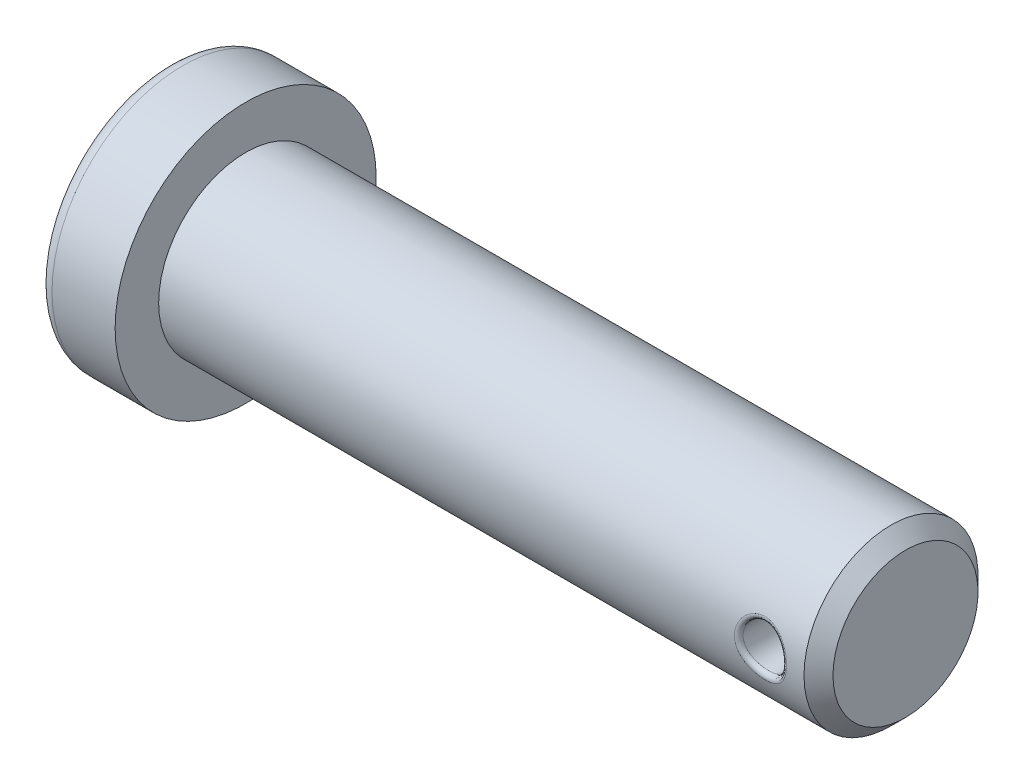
ISO-10303-21;
HEADER;
FILE_DESCRIPTION(('STEP AP214'),'2;1');
FILE_NAME('part.step','',(''),(''),'','','');
FILE_SCHEMA(('AUTOMOTIVE_DESIGN { 1 0 10303 214 1 1 1 1 }'));
ENDSEC;
DATA;
#1=APPLICATION_CONTEXT('core data for automotive mechanical design processes');
#2=APPLICATION_PROTOCOL_DEFINITION('international standard','automotive_design',2000,#1);
#3=PRODUCT_CONTEXT('',#1,'mechanical');
#4=PRODUCT('Part','Part','',(#3));
#5=PRODUCT_RELATED_PRODUCT_CATEGORY('part','',(#4));
#6=PRODUCT_DEFINITION_FORMATION('','',#4);
#7=PRODUCT_DEFINITION_CONTEXT('part definition',#1,'design');
#8=PRODUCT_DEFINITION('design','',#6,#7);
#9=PRODUCT_DEFINITION_SHAPE('','',#8);
#10=(LENGTH_UNIT() NAMED_UNIT(*) SI_UNIT(.MILLI.,.METRE.));
#11=(NAMED_UNIT(*) PLANE_ANGLE_UNIT() SI_UNIT($,.RADIAN.));
#12=(NAMED_UNIT(*) SI_UNIT($,.STERADIAN.) SOLID_ANGLE_UNIT());
#13=UNCERTAINTY_MEASURE_WITH_UNIT(LENGTH_MEASURE(1.E-05),#10,'distance_accuracy_value','');
#14=(GEOMETRIC_REPRESENTATION_CONTEXT(3) GLOBAL_UNCERTAINTY_ASSIGNED_CONTEXT((#13)) GLOBAL_UNIT_ASSIGNED_CONTEXT((#10,
#11,#12)) REPRESENTATION_CONTEXT('',''));
#15=CARTESIAN_POINT('',(0.,0.,0.));
#16=DIRECTION('',(0.,0.,1.));
#17=DIRECTION('',(1.,0.,0.));
#18=AXIS2_PLACEMENT_3D('',#15,#16,#17);
#19=CARTESIAN_POINT('',(34.3231942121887,0.,0.));
#20=DIRECTION('',(-1.,0.,0.));
#21=DIRECTION('',(0.,0.,1.));
#22=AXIS2_PLACEMENT_3D('',#19,#20,#21);
#23=PLANE('',#22);
#24=CARTESIAN_POINT('',(34.3231942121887,0.,0.));
#25=DIRECTION('',(-1.,0.,0.));
#26=DIRECTION('',(0.,0.,1.));
#27=AXIS2_PLACEMENT_3D('',#24,#25,#26);
#28=CIRCLE('',#27,5.);
#29=CARTESIAN_POINT('',(34.3231942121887,0.,5.));
#30=VERTEX_POINT('',#29);
#31=EDGE_CURVE('E131',#30,#30,#28,.T.);
#32=ORIENTED_EDGE('',*,*,#31,.F.);
#33=EDGE_LOOP('',(#32));
#34=FACE_BOUND('',#33,.T.);
#35=ADVANCED_FACE('F31',(#34),#23,.F.);
#36=CARTESIAN_POINT('',(34.3231942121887,0.,0.));
#37=DIRECTION('',(-1.,0.,0.));
#38=DIRECTION('',(0.,0.,1.));
#39=AXIS2_PLACEMENT_3D('',#36,#37,#38);
#40=CONICAL_SURFACE('',#39,5.,0.785398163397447);
#41=CARTESIAN_POINT('',(33.3231942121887,0.,0.));
#42=DIRECTION('',(-1.,0.,0.));
#43=DIRECTION('',(0.,0.,1.));
#44=AXIS2_PLACEMENT_3D('',#41,#42,#43);
#45=CIRCLE('',#44,6.);
#46=CARTESIAN_POINT('',(33.3231942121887,0.,6.));
#47=VERTEX_POINT('',#46);
#48=EDGE_CURVE('E134',#47,#47,#45,.T.);
#49=ORIENTED_EDGE('',*,*,#48,.F.);
#50=EDGE_LOOP('',(#49));
#51=FACE_BOUND('',#50,.T.);
#52=ORIENTED_EDGE('',*,*,#31,.T.);
#53=EDGE_LOOP('',(#52));
#54=FACE_BOUND('',#53,.T.);
#55=ADVANCED_FACE('F77',(#51,#54),#40,.T.);
#56=CARTESIAN_POINT('',(-48.6321569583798,0.,0.));
#57=DIRECTION('',(-1.,0.,0.));
#58=DIRECTION('',(0.,0.,1.));
#59=AXIS2_PLACEMENT_3D('',#56,#57,#58);
#60=CYLINDRICAL_SURFACE('',#59,6.);
#61=CARTESIAN_POINT('',(31.7578216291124,-0.438000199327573,-5.67571531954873));
#62=CARTESIAN_POINT('',(31.7498822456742,-0.464004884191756,-5.98270297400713));
#63=CARTESIAN_POINT('',(32.0447471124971,-0.553263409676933,-5.97443717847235));
#64=CARTESIAN_POINT('',(31.7823448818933,-0.357675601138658,-5.68464105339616));
#65=CARTESIAN_POINT('',(31.777121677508,-0.379966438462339,-5.98896284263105));
#66=CARTESIAN_POINT('',(32.0741750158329,-0.451800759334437,-5.98383268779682));
#67=CARTESIAN_POINT('',(31.8001535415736,-0.275121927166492,-5.69131648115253));
#68=CARTESIAN_POINT('',(31.7972480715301,-0.292380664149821,-5.99376505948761));
#69=CARTESIAN_POINT('',(32.0955454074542,-0.347522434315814,-5.99085945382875));
#70=CARTESIAN_POINT('',(31.8216668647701,-0.108028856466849,-5.69940788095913));
#71=CARTESIAN_POINT('',(31.8214365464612,-0.115097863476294,-5.99956212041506));
#72=CARTESIAN_POINT('',(32.1213613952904,-0.136457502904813,-5.99937671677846));
#73=CARTESIAN_POINT('',(31.8253753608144,-0.0234900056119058,-5.70082528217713));
#74=CARTESIAN_POINT('',(31.8256461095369,-0.0248917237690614,-6.00059210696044));
#75=CARTESIAN_POINT('',(32.1258115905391,-0.0296715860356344,-6.00086871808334));
#76=CARTESIAN_POINT('',(31.8186882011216,0.141619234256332,-5.69829400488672));
#77=CARTESIAN_POINT('',(31.8181186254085,0.150597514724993,-5.99877320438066));
#78=CARTESIAN_POINT('',(32.1177869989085,0.178887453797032,-5.99820421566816));
#79=CARTESIAN_POINT('',(31.8088421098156,0.222214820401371,-5.69455440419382));
#80=CARTESIAN_POINT('',(31.8069616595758,0.236426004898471,-5.99606543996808));
#81=CARTESIAN_POINT('',(32.1059716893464,0.280692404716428,-5.99426779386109));
#82=CARTESIAN_POINT('',(31.77637159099,0.380533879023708,-5.68247681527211));
#83=CARTESIAN_POINT('',(31.7705391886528,0.403893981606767,-5.98745940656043));
#84=CARTESIAN_POINT('',(32.0670070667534,0.480674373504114,-5.98155454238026));
#85=CARTESIAN_POINT('',(31.7537468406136,0.45825727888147,-5.67413871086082));
#86=CARTESIAN_POINT('',(31.7450812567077,0.485944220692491,-5.98151665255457));
#87=CARTESIAN_POINT('',(32.0398573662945,0.578851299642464,-5.97277759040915));
#88=CARTESIAN_POINT('',(31.6963808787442,0.609003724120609,-5.6536931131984));
#89=CARTESIAN_POINT('',(31.6813275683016,0.643569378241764,-5.96725308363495));
#90=CARTESIAN_POINT('',(31.9710182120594,0.769267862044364,-5.95125590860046));
#91=CARTESIAN_POINT('',(31.6616004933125,0.68201065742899,-5.641573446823));
#92=CARTESIAN_POINT('',(31.6426945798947,0.719395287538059,-5.95886435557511));
#93=CARTESIAN_POINT('',(31.9292817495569,0.861487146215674,-5.93849836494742));
#94=CARTESIAN_POINT('',(31.5808968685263,0.821391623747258,-5.61477078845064));
#95=CARTESIAN_POINT('',(31.55437331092,0.862379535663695,-5.94080584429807));
#96=CARTESIAN_POINT('',(31.8324373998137,1.03754731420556,-5.91028504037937));
#97=CARTESIAN_POINT('',(31.5349523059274,0.887752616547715,-5.60008290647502));
#98=CARTESIAN_POINT('',(31.504337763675,0.92961568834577,-5.93108291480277));
#99=CARTESIAN_POINT('',(31.7773039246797,1.12137172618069,-5.89482411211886));
#100=CARTESIAN_POINT('',(31.4310207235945,1.01475582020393,-5.56897592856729));
#101=CARTESIAN_POINT('',(31.3930668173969,1.05640733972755,-5.91114554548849));
#102=CARTESIAN_POINT('',(31.6525860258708,1.28179682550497,-5.86207992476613));
#103=CARTESIAN_POINT('',(31.3726126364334,1.07504581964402,-5.55251025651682));
#104=CARTESIAN_POINT('',(31.3311983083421,1.11537785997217,-5.90091449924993));
#105=CARTESIAN_POINT('',(31.5824963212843,1.35795261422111,-5.84474763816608));
#106=CARTESIAN_POINT('',(31.2466200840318,1.18501732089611,-5.52018792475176));
#107=CARTESIAN_POINT('',(31.2004878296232,1.22101614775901,-5.88160614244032));
#108=CARTESIAN_POINT('',(31.4313052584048,1.49686398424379,-5.81072413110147));
#109=CARTESIAN_POINT('',(31.1790510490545,1.23471630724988,-5.50433029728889));
#110=CARTESIAN_POINT('',(31.1315189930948,1.26742811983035,-5.87255371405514));
#111=CARTESIAN_POINT('',(31.3502224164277,1.55964165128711,-5.79403189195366));
#112=CARTESIAN_POINT('',(31.0347952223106,1.32322796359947,-5.47464816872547));
#113=CARTESIAN_POINT('',(30.9874228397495,1.34859835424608,-5.85629244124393));
#114=CARTESIAN_POINT('',(31.177115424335,1.6714458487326,-5.7627875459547));
#115=CARTESIAN_POINT('',(30.9579460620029,1.36178866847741,-5.46087365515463));
#116=CARTESIAN_POINT('',(30.9123393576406,1.3826779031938,-5.84919832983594));
#117=CARTESIAN_POINT('',(31.0848964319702,1.7201541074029,-5.74828805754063));
#118=CARTESIAN_POINT('',(30.7984125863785,1.42531845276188,-5.43748075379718));
#119=CARTESIAN_POINT('',(30.7595368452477,1.43802749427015,-5.83757238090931));
#120=CARTESIAN_POINT('',(30.8934562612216,1.80040225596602,-5.72366395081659));
#121=CARTESIAN_POINT('',(30.7157301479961,1.45029188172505,-5.42786103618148));
#122=CARTESIAN_POINT('',(30.6822163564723,1.45891892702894,-5.8331178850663));
#123=CARTESIAN_POINT('',(30.7942373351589,1.83194764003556,-5.71353793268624));
#124=CARTESIAN_POINT('',(30.5499700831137,1.48508919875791,-5.41429257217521));
#125=CARTESIAN_POINT('',(30.5290213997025,1.48793538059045,-5.82692836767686));
#126=CARTESIAN_POINT('',(30.5953252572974,1.87590214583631,-5.69925533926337));
#127=CARTESIAN_POINT('',(30.4670087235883,1.49541521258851,-5.41015619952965));
#128=CARTESIAN_POINT('',(30.4537347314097,1.49625957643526,-5.82515095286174));
#129=CARTESIAN_POINT('',(30.4957716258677,1.88894553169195,-5.69490126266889));
#130=CARTESIAN_POINT('',(30.3004699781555,1.50213998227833,-5.40747360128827));
#131=CARTESIAN_POINT('',(30.3024367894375,1.50175174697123,-5.82397776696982));
#132=CARTESIAN_POINT('',(30.2959251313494,1.89743997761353,-5.69207747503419));
#133=CARTESIAN_POINT('',(30.2168927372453,1.49854191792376,-5.4089260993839));
#134=CARTESIAN_POINT('',(30.2270761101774,1.49887557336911,-5.8245914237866));
#135=CARTESIAN_POINT('',(30.1956324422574,1.89289505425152,-5.69360642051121));
#136=CARTESIAN_POINT('',(30.0547422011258,1.47796088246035,-5.4170713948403));
#137=CARTESIAN_POINT('',(30.078830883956,1.48193673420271,-5.82820931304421));
#138=CARTESIAN_POINT('',(30.0010517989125,1.86689795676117,-5.70218041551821));
#139=CARTESIAN_POINT('',(29.9760979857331,1.46147583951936,-5.42356918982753));
#140=CARTESIAN_POINT('',(30.0065368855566,1.46842127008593,-5.83109661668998));
#141=CARTESIAN_POINT('',(29.9066787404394,1.8460747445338,-5.70902019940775));
#142=CARTESIAN_POINT('',(29.8227373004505,1.41631040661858,-5.44079543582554));
#143=CARTESIAN_POINT('',(29.8626566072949,1.43006076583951,-5.83924333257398));
#144=CARTESIAN_POINT('',(29.7226459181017,1.78902367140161,-5.72715308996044));
#145=CARTESIAN_POINT('',(29.7480213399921,1.38762843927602,-5.45152443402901));
#146=CARTESIAN_POINT('',(29.7914958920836,1.40547370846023,-5.84444838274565));
#147=CARTESIAN_POINT('',(29.6329867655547,1.75279381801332,-5.73844677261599));
#148=CARTESIAN_POINT('',(29.6029432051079,1.31826873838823,-5.47626097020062));
#149=CARTESIAN_POINT('',(29.6502934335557,1.34385187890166,-5.85721502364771));
#150=CARTESIAN_POINT('',(29.4588930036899,1.6651815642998,-5.76448523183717));
#151=CARTESIAN_POINT('',(29.5326971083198,1.277363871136,-5.49032944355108));
#152=CARTESIAN_POINT('',(29.5805199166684,1.30690883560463,-5.86475717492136));
#153=CARTESIAN_POINT('',(29.3745976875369,1.6135122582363,-5.77929415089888));
#154=CARTESIAN_POINT('',(29.3997480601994,1.18482997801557,-5.52012677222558));
#155=CARTESIAN_POINT('',(29.4459099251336,1.22063271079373,-5.88159975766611));
#156=CARTESIAN_POINT('',(29.2150588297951,1.49662734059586,-5.81065975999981));
#157=CARTESIAN_POINT('',(29.3370602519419,1.13317997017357,-5.53585884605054));
#158=CARTESIAN_POINT('',(29.3810956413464,1.17159385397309,-5.89085464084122));
#159=CARTESIAN_POINT('',(29.139833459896,1.43138522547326,-5.82721983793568));
#160=CARTESIAN_POINT('',(29.2181605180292,1.01787357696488,-5.56806316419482));
#161=CARTESIAN_POINT('',(29.2564839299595,1.05943195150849,-5.91055002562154));
#162=CARTESIAN_POINT('',(28.9971537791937,1.28573504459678,-5.8611191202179));
#163=CARTESIAN_POINT('',(29.1623752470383,0.953776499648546,-5.58453639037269));
#164=CARTESIAN_POINT('',(29.1967887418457,0.99594625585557,-5.92102273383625));
#165=CARTESIAN_POINT('',(28.9302114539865,1.20477031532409,-5.87845935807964));
#166=CARTESIAN_POINT('',(29.0623830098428,0.81701636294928,-5.61566813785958));
#167=CARTESIAN_POINT('',(29.088875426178,0.858045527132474,-5.94134830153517));
#168=CARTESIAN_POINT('',(28.810220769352,1.03202066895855,-5.91122961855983));
#169=CARTESIAN_POINT('',(29.0181546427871,0.744369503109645,-5.63032998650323));
#170=CARTESIAN_POINT('',(29.0402887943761,0.783685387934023,-5.95123889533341));
#171=CARTESIAN_POINT('',(28.7571467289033,0.940256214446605,-5.92666314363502));
#172=CARTESIAN_POINT('',(28.9434800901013,0.594324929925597,-5.6559173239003));
#173=CARTESIAN_POINT('',(28.9579932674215,0.628432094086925,-5.96874819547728));
#174=CARTESIAN_POINT('',(28.6675372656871,0.750726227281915,-5.95359718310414));
#175=CARTESIAN_POINT('',(28.9126986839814,0.517104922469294,-5.66693180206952));
#176=CARTESIAN_POINT('',(28.9235829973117,0.547610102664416,-5.9764801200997));
#177=CARTESIAN_POINT('',(28.6305995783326,0.653185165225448,-5.96519137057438));
#178=CARTESIAN_POINT('',(28.8642612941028,0.358326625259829,-5.68456203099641));
#179=CARTESIAN_POINT('',(28.8695065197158,0.380638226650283,-5.98890810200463));
#180=CARTESIAN_POINT('',(28.5724747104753,0.452623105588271,-5.98374950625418));
#181=CARTESIAN_POINT('',(28.8466010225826,0.276769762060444,-5.69117921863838));
#182=CARTESIAN_POINT('',(28.8495527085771,0.294121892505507,-5.99366664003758));
#183=CARTESIAN_POINT('',(28.5512823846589,0.349603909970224,-5.99071496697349));
#184=CARTESIAN_POINT('',(28.825313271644,0.113752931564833,-5.69918489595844));
#185=CARTESIAN_POINT('',(28.8256154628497,0.121164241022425,-5.99940266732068));
#186=CARTESIAN_POINT('',(28.5257370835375,0.143687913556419,-5.99914199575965));
#187=CARTESIAN_POINT('',(28.8213451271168,0.0323417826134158,-5.7007002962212));
#188=CARTESIAN_POINT('',(28.821113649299,0.034323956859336,-6.00050304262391));
#189=CARTESIAN_POINT('',(28.5209753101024,0.0408527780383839,-6.00073715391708));
#190=CARTESIAN_POINT('',(28.8266333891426,-0.130004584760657,-5.6986972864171));
#191=CARTESIAN_POINT('',(28.8270689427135,-0.138246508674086,-5.99906288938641));
#192=CARTESIAN_POINT('',(28.527321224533,-0.164216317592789,-5.99862872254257));
#193=CARTESIAN_POINT('',(28.835889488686,-0.210939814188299,-5.69517899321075));
#194=CARTESIAN_POINT('',(28.8375590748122,-0.224458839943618,-5.99651434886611));
#195=CARTESIAN_POINT('',(28.5384285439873,-0.266450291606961,-5.9949252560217));
#196=CARTESIAN_POINT('',(28.8672735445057,-0.369942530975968,-5.68349004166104));
#197=CARTESIAN_POINT('',(28.8727721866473,-0.39271026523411,-5.9881799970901));
#198=CARTESIAN_POINT('',(28.5760894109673,-0.467295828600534,-5.98262109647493));
#199=CARTESIAN_POINT('',(28.8893896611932,-0.44801258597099,-5.67532366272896));
#200=CARTESIAN_POINT('',(28.8976694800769,-0.475172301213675,-5.98235367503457));
#201=CARTESIAN_POINT('',(28.6026287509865,-0.565910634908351,-5.97402490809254));
#202=CARTESIAN_POINT('',(28.9457404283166,-0.59928229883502,-5.65519131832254));
#203=CARTESIAN_POINT('',(28.9603272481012,-0.633446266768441,-5.96829185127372));
#204=CARTESIAN_POINT('',(28.6702496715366,-0.756988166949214,-5.95283296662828));
#205=CARTESIAN_POINT('',(28.9799772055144,-0.672481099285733,-5.64322468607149));
#206=CARTESIAN_POINT('',(28.9983833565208,-0.709539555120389,-5.95999568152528));
#207=CARTESIAN_POINT('',(28.7113338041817,-0.849449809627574,-5.94023651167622));
#208=CARTESIAN_POINT('',(29.0603094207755,-0.81353228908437,-5.61644419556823));
#209=CARTESIAN_POINT('',(29.0863812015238,-0.854401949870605,-5.94191676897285));
#210=CARTESIAN_POINT('',(28.8077324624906,-1.0276197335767,-5.91204652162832));
#211=CARTESIAN_POINT('',(29.1066180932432,-0.881256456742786,-5.60158049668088));
#212=CARTESIAN_POINT('',(29.1368636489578,-0.923091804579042,-5.93205737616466));
#213=CARTESIAN_POINT('',(28.8633028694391,-1.11316605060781,-5.89640052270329));
#214=CARTESIAN_POINT('',(29.2096111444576,-1.00828269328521,-5.57064776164));
#215=CARTESIAN_POINT('',(29.2471713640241,-1.04997666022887,-5.91220532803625));
#216=CARTESIAN_POINT('',(28.9868945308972,-1.27362024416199,-5.86383974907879));
#217=CARTESIAN_POINT('',(29.2663156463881,-1.0675680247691,-5.55457642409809));
#218=CARTESIAN_POINT('',(29.3073002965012,-1.10806049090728,-5.90219158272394));
#219=CARTESIAN_POINT('',(29.0549399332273,-1.34850697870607,-5.84692255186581));
#220=CARTESIAN_POINT('',(29.3911019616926,-1.17831830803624,-5.52227510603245));
#221=CARTESIAN_POINT('',(29.4370339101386,-1.2147126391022,-5.88281394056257));
#222=CARTESIAN_POINT('',(29.2046835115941,-1.48840207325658,-5.8129211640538));
#223=CARTESIAN_POINT('',(29.4595453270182,-1.22938072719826,-5.50606403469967));
#224=CARTESIAN_POINT('',(29.5070164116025,-1.26248806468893,-5.87352529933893));
#225=CARTESIAN_POINT('',(29.2868155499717,-1.55290197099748,-5.79585687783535));
#226=CARTESIAN_POINT('',(29.6042303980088,-1.31921439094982,-5.47604480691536));
#227=CARTESIAN_POINT('',(29.6516957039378,-1.34498368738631,-5.85703344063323));
#228=CARTESIAN_POINT('',(29.4604376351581,-1.6663760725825,-5.76425769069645));
#229=CARTESIAN_POINT('',(29.6804568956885,-1.35800902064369,-5.46223210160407));
#230=CARTESIAN_POINT('',(29.726283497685,-1.37933885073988,-5.84989310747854));
#231=CARTESIAN_POINT('',(29.5519094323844,-1.71537981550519,-5.74971800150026));
#232=CARTESIAN_POINT('',(29.8382684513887,-1.42198672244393,-5.43873748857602));
#233=CARTESIAN_POINT('',(29.8776504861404,-1.43517277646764,-5.83817774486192));
#234=CARTESIAN_POINT('',(29.7412832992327,-1.79619375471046,-5.72498683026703));
#235=CARTESIAN_POINT('',(29.9198152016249,-1.44725715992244,-5.42902915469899));
#236=CARTESIAN_POINT('',(29.9540442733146,-1.45636348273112,-5.83366170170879));
#237=CARTESIAN_POINT('',(29.8391393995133,-1.82811430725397,-5.71476753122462));
#238=CARTESIAN_POINT('',(30.0863072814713,-1.48362317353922,-5.41487762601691));
#239=CARTESIAN_POINT('',(30.1081509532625,-1.48674867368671,-5.82718221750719));
#240=CARTESIAN_POINT('',(30.0389298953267,-1.87405032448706,-5.69987118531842));
#241=CARTESIAN_POINT('',(30.1712512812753,-1.49472424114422,-5.41043239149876));
#242=CARTESIAN_POINT('',(30.1852691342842,-1.49569840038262,-5.82527091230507));
#243=CARTESIAN_POINT('',(30.1408626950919,-1.88807272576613,-5.695191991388));
#244=CARTESIAN_POINT('',(30.3378742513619,-1.50213652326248,-5.40747448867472));
#245=CARTESIAN_POINT('',(30.336660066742,-1.50174736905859,-5.82397857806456));
#246=CARTESIAN_POINT('',(30.3408102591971,-1.89743560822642,-5.69207840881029));
#247=CARTESIAN_POINT('',(30.4195209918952,-1.49911259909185,-5.40869511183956));
#248=CARTESIAN_POINT('',(30.4102853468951,-1.49932934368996,-5.82449448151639));
#249=CARTESIAN_POINT('',(30.4387863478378,-1.89361591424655,-5.69336327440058));
#250=CARTESIAN_POINT('',(30.5810732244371,-1.47990372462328,-5.41630673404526));
#251=CARTESIAN_POINT('',(30.5578446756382,-1.48354185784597,-5.82786674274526));
#252=CARTESIAN_POINT('',(30.6326490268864,-1.86935207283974,-5.70137550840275));
#253=CARTESIAN_POINT('',(30.6609787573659,-1.46371908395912,-5.42269761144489));
#254=CARTESIAN_POINT('',(30.6311986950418,-1.47029787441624,-5.83069629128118));
#255=CARTESIAN_POINT('',(30.7285356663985,-1.84890831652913,-5.70810274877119));
#256=CARTESIAN_POINT('',(30.8158503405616,-1.41905201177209,-5.43976383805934));
#257=CARTESIAN_POINT('',(30.7763404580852,-1.43240863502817,-5.83874647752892));
#258=CARTESIAN_POINT('',(30.914381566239,-1.7924867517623,-5.72606719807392));
#259=CARTESIAN_POINT('',(30.8908648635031,-1.39072246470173,-5.45038581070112));
#260=CARTESIAN_POINT('',(30.8476884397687,-1.40816643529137,-5.84388224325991));
#261=CARTESIAN_POINT('',(31.0043989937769,-1.75670206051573,-5.73724822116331));
#262=CARTESIAN_POINT('',(31.0352810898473,-1.32261877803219,-5.47474129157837));
#263=CARTESIAN_POINT('',(30.9880831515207,-1.34774949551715,-5.85641498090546));
#264=CARTESIAN_POINT('',(31.1776984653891,-1.67067635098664,-5.76288556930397));
#265=CARTESIAN_POINT('',(31.1046718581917,-1.28282299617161,-5.4884806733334));
#266=CARTESIAN_POINT('',(31.0568870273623,-1.31187738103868,-5.86375245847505));
#267=CARTESIAN_POINT('',(31.2609673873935,-1.62040799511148,-5.77734807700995));
#268=CARTESIAN_POINT('',(31.2388544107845,-1.1909866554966,-5.518225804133));
#269=CARTESIAN_POINT('',(31.1924469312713,-1.22647466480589,-5.88048988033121));
#270=CARTESIAN_POINT('',(31.4219864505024,-1.50440419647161,-5.8086587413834));
#271=CARTESIAN_POINT('',(31.3033325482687,-1.1385036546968,-5.5343022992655));
#272=CARTESIAN_POINT('',(31.2590283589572,-1.17673911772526,-5.88991704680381));
#273=CARTESIAN_POINT('',(31.4993602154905,-1.43810987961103,-5.8255813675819));
#274=CARTESIAN_POINT('',(31.4226558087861,-1.02373225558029,-5.56649135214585));
#275=CARTESIAN_POINT('',(31.3840396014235,-1.06515803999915,-5.90957532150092));
#276=CARTESIAN_POINT('',(31.6425481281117,-1.29313548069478,-5.85946458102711));
#277=CARTESIAN_POINT('',(31.4775158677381,-0.961459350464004,-5.58260381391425));
#278=CARTESIAN_POINT('',(31.4426687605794,-1.00355932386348,-5.91979207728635));
#279=CARTESIAN_POINT('',(31.7083801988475,-1.21447496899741,-5.87642506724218));
#280=CARTESIAN_POINT('',(31.5779113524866,-0.826427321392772,-5.61368977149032));
#281=CARTESIAN_POINT('',(31.5508587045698,-0.867638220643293,-5.94002901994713));
#282=CARTESIAN_POINT('',(31.8288547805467,-1.04390819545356,-5.90914712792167));
#283=CARTESIAN_POINT('',(31.6230968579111,-0.753398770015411,-5.62861110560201));
#284=CARTESIAN_POINT('',(31.600455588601,-0.79297637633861,-5.95007424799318));
#285=CARTESIAN_POINT('',(31.8830773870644,-0.951661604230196,-5.92485379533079));
#286=CARTESIAN_POINT('',(31.7004797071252,-0.600360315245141,-5.65504806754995));
#287=CARTESIAN_POINT('',(31.6856620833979,-0.634781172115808,-5.96813451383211));
#288=CARTESIAN_POINT('',(31.9759368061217,-0.758349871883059,-5.95268217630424));
#289=CARTESIAN_POINT('',(31.7326795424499,-0.520351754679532,-5.66656434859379));
#290=CARTESIAN_POINT('',(31.7216669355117,-0.551054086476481,-5.97621883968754));
#291=CARTESIAN_POINT('',(32.0145766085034,-0.657286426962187,-5.96480457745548));
#292=CARTESIAN_POINT('',(31.7578216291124,-0.438000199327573,-5.67571531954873));
#293=CARTESIAN_POINT('',(31.7498822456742,-0.464004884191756,-5.98270297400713));
#294=CARTESIAN_POINT('',(32.0447471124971,-0.553263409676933,-5.97443717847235));
#295=(BOUNDED_SURFACE() B_SPLINE_SURFACE(3,2,((#61,#62,#63),(#64,#65,#66),(#67,#68,#69),(#70,
#71,#72),(#73,#74,#75),(#76,#77,#78),(#79,#80,#81),(#82,#83,#84),(#85,#86,#87),(#88,#89,#90),
(#91,#92,#93),(#94,#95,#96),(#97,#98,#99),(#100,#101,#102),(#103,#104,#105),(#106,#107,#108),
(#109,#110,#111),(#112,#113,#114),(#115,#116,#117),(#118,#119,#120),(#121,#122,#123),(#124,#125,
#126),(#127,#128,#129),(#130,#131,#132),(#133,#134,#135),(#136,#137,#138),(#139,#140,#141),
(#142,#143,#144),(#145,#146,#147),(#148,#149,#150),(#151,#152,#153),(#154,#155,#156),(#157,#158,
#159),(#160,#161,#162),(#163,#164,#165),(#166,#167,#168),(#169,#170,#171),(#172,#173,#174),
(#175,#176,#177),(#178,#179,#180),(#181,#182,#183),(#184,#185,#186),(#187,#188,#189),(#190,#191,
#192),(#193,#194,#195),(#196,#197,#198),(#199,#200,#201),(#202,#203,#204),(#205,#206,#207),
(#208,#209,#210),(#211,#212,#213),(#214,#215,#216),(#217,#218,#219),(#220,#221,#222),(#223,#224,
#225),(#226,#227,#228),(#229,#230,#231),(#232,#233,#234),(#235,#236,#237),(#238,#239,#240),
(#241,#242,#243),(#244,#245,#246),(#247,#248,#249),(#250,#251,#252),(#253,#254,#255),(#256,#257,
#258),(#259,#260,#261),(#262,#263,#264),(#265,#266,#267),(#268,#269,#270),(#271,#272,#273),
(#274,#275,#276),(#277,#278,#279),(#280,#281,#282),(#283,#284,#285),(#286,#287,#288),(#289,#290,
#291),(#292,#293,#294)),.UNSPECIFIED.,.T.,.F.,.F.) B_SPLINE_SURFACE_WITH_KNOTS((4,2,2,2,2,2,2,2,
2,2,2,2,2,2,2,2,2,2,2,2,2,2,2,2,2,2,2,2,2,2,2,2,2,2,2,2,2,2,4),(3,3),(0.,0.303145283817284,
0.60620816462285,0.897338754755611,1.18847670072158,1.48056168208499,1.7732089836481,
2.07801656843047,2.3823169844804,2.6930413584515,3.00366620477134,3.30336157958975,
3.60298851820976,3.89157840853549,4.18020563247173,4.47457059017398,4.76951584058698,
5.07793486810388,5.38577865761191,5.68543626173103,5.9849958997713,6.27704643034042,
6.56909018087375,6.86086548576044,7.15269201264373,7.45007096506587,7.74803175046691,
8.05778884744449,8.36695186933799,8.67409284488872,8.98111474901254,9.27383477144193,
9.56654790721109,9.85567973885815,10.1453609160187,10.4471554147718,10.74847702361,
11.0593317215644,11.37012674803),(0.,1.),
.UNSPECIFIED.) GEOMETRIC_REPRESENTATION_ITEM() RATIONAL_B_SPLINE_SURFACE(((1.,0.697522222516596,
1.),(1.,0.701061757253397,1.),(1.,0.703691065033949,1.),(1.,0.70687546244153,1.),(1.,
0.707431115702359,1.),(1.,0.706436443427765,1.),(1.,0.704968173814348,1.),(1.,0.700202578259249,
1.),(1.,0.696905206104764,1.),(1.,0.688759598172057,1.),(1.,0.683906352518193,1.),(1.,
0.673071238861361,1.),(1.,0.667087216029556,1.),(1.,0.654274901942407,1.),(1.,0.647421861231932,
1.),(1.,0.633808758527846,1.),(1.,0.627048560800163,1.),(1.,0.614255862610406,1.),(1.,
0.60824173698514,1.),(1.,0.597942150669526,1.),(1.,0.593656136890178,1.),(1.,0.587587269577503,
1.),(1.,0.585721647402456,1.),(1.,0.58451338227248,1.),(1.,0.585170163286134,1.),(1.,
0.588829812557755,1.),(1.,0.591745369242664,1.),(1.,0.599401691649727,1.),(1.,0.604142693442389,
1.),(1.,0.614948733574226,1.),(1.,0.621038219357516,1.),(1.,0.633779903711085,1.),(1.,
0.640433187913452,1.),(1.,0.653899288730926,1.),(1.,0.660705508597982,1.),(1.,0.673442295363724,
1.),(1.,0.679374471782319,1.),(1.,0.689653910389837,1.),(1.,0.69403912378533,1.),(1.,
0.70103037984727,1.),(1.,0.703637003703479,1.),(1.,0.706787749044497,1.),(1.,0.707381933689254,
1.),(1.,0.706594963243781,1.),(1.,0.705213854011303,1.),(1.,0.700603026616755,1.),(1.,
0.697375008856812,1.),(1.,0.689358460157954,1.),(1.,0.684569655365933,1.),(1.,0.673751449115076,
1.),(1.,0.667700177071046,1.),(1.,0.654967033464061,1.),(1.,0.648283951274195,1.),(1.,
0.634695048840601,1.),(1.,0.627790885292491,1.),(1.,0.614862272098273,1.),(1.,0.608836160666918,
1.),(1.,0.598498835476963,1.),(1.,0.594176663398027,1.),(1.,0.587850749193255,1.),(1.,
0.585846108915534,1.),(1.,0.584513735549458,1.),(1.,0.585065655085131,1.),(1.,0.588486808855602,
1.),(1.,0.591355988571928,1.),(1.,0.598944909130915,1.),(1.,0.60364157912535,1.),(1.,
0.614288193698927,1.),(1.,0.620240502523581,1.),(1.,0.632973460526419,1.),(1.,0.639778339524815,
1.),(1.,0.653245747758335,1.),(1.,0.659908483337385,1.),(1.,0.672638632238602,1.),(1.,
0.678680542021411,1.),(1.,0.68930777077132,1.),(1.,0.693893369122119,1.),(1.,0.697522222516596,1.))) REPRESENTATION_ITEM('') SURFACE());
#296=CARTESIAN_POINT('',(32.0447471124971,-0.553263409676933,-5.97443717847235));
#297=CARTESIAN_POINT('',(32.0741750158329,-0.451800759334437,-5.98383268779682));
#298=CARTESIAN_POINT('',(32.0955454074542,-0.347522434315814,-5.99085945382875));
#299=CARTESIAN_POINT('',(32.1213613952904,-0.136457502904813,-5.99937671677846));
#300=CARTESIAN_POINT('',(32.1258115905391,-0.0296715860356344,-6.00086871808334));
#301=CARTESIAN_POINT('',(32.1177869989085,0.178887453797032,-5.99820421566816));
#302=CARTESIAN_POINT('',(32.1059716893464,0.280692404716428,-5.99426779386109));
#303=CARTESIAN_POINT('',(32.0670070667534,0.480674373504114,-5.98155454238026));
#304=CARTESIAN_POINT('',(32.0398573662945,0.578851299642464,-5.97277759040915));
#305=CARTESIAN_POINT('',(31.9710182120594,0.769267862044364,-5.95125590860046));
#306=CARTESIAN_POINT('',(31.9292817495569,0.861487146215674,-5.93849836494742));
#307=CARTESIAN_POINT('',(31.8324373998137,1.03754731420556,-5.91028504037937));
#308=CARTESIAN_POINT('',(31.7773039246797,1.12137172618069,-5.89482411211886));
#309=CARTESIAN_POINT('',(31.6525860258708,1.28179682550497,-5.86207992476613));
#310=CARTESIAN_POINT('',(31.5824963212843,1.35795261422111,-5.84474763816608));
#311=CARTESIAN_POINT('',(31.4313052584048,1.49686398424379,-5.81072413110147));
#312=CARTESIAN_POINT('',(31.3502224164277,1.55964165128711,-5.79403189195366));
#313=CARTESIAN_POINT('',(31.177115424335,1.6714458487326,-5.7627875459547));
#314=CARTESIAN_POINT('',(31.0848964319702,1.7201541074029,-5.74828805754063));
#315=CARTESIAN_POINT('',(30.8934562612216,1.80040225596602,-5.72366395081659));
#316=CARTESIAN_POINT('',(30.7942373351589,1.83194764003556,-5.71353793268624));
#317=CARTESIAN_POINT('',(30.5953252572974,1.87590214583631,-5.69925533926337));
#318=CARTESIAN_POINT('',(30.4957716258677,1.88894553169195,-5.69490126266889));
#319=CARTESIAN_POINT('',(30.2959251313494,1.89743997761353,-5.69207747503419));
#320=CARTESIAN_POINT('',(30.1956324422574,1.89289505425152,-5.69360642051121));
#321=CARTESIAN_POINT('',(30.0010517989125,1.86689795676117,-5.70218041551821));
#322=CARTESIAN_POINT('',(29.9066787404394,1.8460747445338,-5.70902019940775));
#323=CARTESIAN_POINT('',(29.7226459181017,1.78902367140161,-5.72715308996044));
#324=CARTESIAN_POINT('',(29.6329867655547,1.75279381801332,-5.73844677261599));
#325=CARTESIAN_POINT('',(29.4588930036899,1.6651815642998,-5.76448523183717));
#326=CARTESIAN_POINT('',(29.3745976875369,1.6135122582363,-5.77929415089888));
#327=CARTESIAN_POINT('',(29.2150588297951,1.49662734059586,-5.81065975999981));
#328=CARTESIAN_POINT('',(29.139833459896,1.43138522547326,-5.82721983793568));
#329=CARTESIAN_POINT('',(28.9971537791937,1.28573504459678,-5.8611191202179));
#330=CARTESIAN_POINT('',(28.9302114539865,1.20477031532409,-5.87845935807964));
#331=CARTESIAN_POINT('',(28.810220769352,1.03202066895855,-5.91122961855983));
#332=CARTESIAN_POINT('',(28.7571467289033,0.940256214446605,-5.92666314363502));
#333=CARTESIAN_POINT('',(28.6675372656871,0.750726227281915,-5.95359718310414));
#334=CARTESIAN_POINT('',(28.6305995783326,0.653185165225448,-5.96519137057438));
#335=CARTESIAN_POINT('',(28.5724747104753,0.452623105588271,-5.98374950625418));
#336=CARTESIAN_POINT('',(28.5512823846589,0.349603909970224,-5.99071496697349));
#337=CARTESIAN_POINT('',(28.5257370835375,0.143687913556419,-5.99914199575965));
#338=CARTESIAN_POINT('',(28.5209753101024,0.0408527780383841,-6.00073715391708));
#339=CARTESIAN_POINT('',(28.527321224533,-0.164216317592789,-5.99862872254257));
#340=CARTESIAN_POINT('',(28.5384285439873,-0.266450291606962,-5.9949252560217));
#341=CARTESIAN_POINT('',(28.5760894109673,-0.467295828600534,-5.98262109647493));
#342=CARTESIAN_POINT('',(28.6026287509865,-0.565910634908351,-5.97402490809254));
#343=CARTESIAN_POINT('',(28.6702496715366,-0.756988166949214,-5.95283296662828));
#344=CARTESIAN_POINT('',(28.7113338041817,-0.849449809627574,-5.94023651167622));
#345=CARTESIAN_POINT('',(28.8077324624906,-1.0276197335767,-5.91204652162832));
#346=CARTESIAN_POINT('',(28.8633028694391,-1.11316605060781,-5.89640052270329));
#347=CARTESIAN_POINT('',(28.9868945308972,-1.27362024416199,-5.86383974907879));
#348=CARTESIAN_POINT('',(29.0549399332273,-1.34850697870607,-5.84692255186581));
#349=CARTESIAN_POINT('',(29.2046835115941,-1.48840207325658,-5.8129211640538));
#350=CARTESIAN_POINT('',(29.2868155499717,-1.55290197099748,-5.79585687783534));
#351=CARTESIAN_POINT('',(29.4604376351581,-1.6663760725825,-5.76425769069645));
#352=CARTESIAN_POINT('',(29.5519094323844,-1.71537981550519,-5.74971800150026));
#353=CARTESIAN_POINT('',(29.7412832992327,-1.79619375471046,-5.72498683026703));
#354=CARTESIAN_POINT('',(29.8391393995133,-1.82811430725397,-5.71476753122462));
#355=CARTESIAN_POINT('',(30.0389298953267,-1.87405032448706,-5.69987118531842));
#356=CARTESIAN_POINT('',(30.1408626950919,-1.88807272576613,-5.695191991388));
#357=CARTESIAN_POINT('',(30.3408102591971,-1.89743560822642,-5.69207840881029));
#358=CARTESIAN_POINT('',(30.4387863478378,-1.89361591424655,-5.69336327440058));
#359=CARTESIAN_POINT('',(30.6326490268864,-1.86935207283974,-5.70137550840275));
#360=CARTESIAN_POINT('',(30.7285356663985,-1.84890831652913,-5.70810274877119));
#361=CARTESIAN_POINT('',(30.914381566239,-1.7924867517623,-5.72606719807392));
#362=CARTESIAN_POINT('',(31.0043989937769,-1.75670206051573,-5.73724822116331));
#363=CARTESIAN_POINT('',(31.1776984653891,-1.67067635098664,-5.76288556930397));
#364=CARTESIAN_POINT('',(31.2609673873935,-1.62040799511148,-5.77734807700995));
#365=CARTESIAN_POINT('',(31.4219864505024,-1.50440419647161,-5.8086587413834));
#366=CARTESIAN_POINT('',(31.4993602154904,-1.43810987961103,-5.8255813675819));
#367=CARTESIAN_POINT('',(31.6425481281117,-1.29313548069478,-5.85946458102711));
#368=CARTESIAN_POINT('',(31.7083801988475,-1.21447496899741,-5.87642506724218));
#369=CARTESIAN_POINT('',(31.8288547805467,-1.04390819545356,-5.90914712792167));
#370=CARTESIAN_POINT('',(31.8830773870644,-0.951661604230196,-5.92485379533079));
#371=CARTESIAN_POINT('',(31.9759368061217,-0.758349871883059,-5.95268217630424));
#372=CARTESIAN_POINT('',(32.0145766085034,-0.657286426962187,-5.96480457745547));
#373=CARTESIAN_POINT('',(32.0447471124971,-0.553263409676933,-5.97443717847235));
#374=B_SPLINE_CURVE_WITH_KNOTS('',3,(#296,#297,#298,#299,#300,#301,#302,#303,#304,#305,#306,
#307,#308,#309,#310,#311,#312,#313,#314,#315,#316,#317,#318,#319,#320,#321,#322,#323,#324,#325,
#326,#327,#328,#329,#330,#331,#332,#333,#334,#335,#336,#337,#338,#339,#340,#341,#342,#343,#344,
#345,#346,#347,#348,#349,#350,#351,#352,#353,#354,#355,#356,#357,#358,#359,#360,#361,#362,#363,
#364,#365,#366,#367,#368,#369,#370,#371,#372,#373),.UNSPECIFIED.,.T.,.F.,(4,2,2,2,2,2,2,2,2,2,2,
2,2,2,2,2,2,2,2,2,2,2,2,2,2,2,2,2,2,2,2,2,2,2,2,2,2,2,4),(0.,0.303145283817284,0.60620816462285,
0.897338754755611,1.18847670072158,1.48056168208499,1.7732089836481,2.07801656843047,
2.3823169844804,2.6930413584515,3.00366620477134,3.30336157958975,3.60298851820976,
3.89157840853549,4.18020563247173,4.47457059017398,4.76951584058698,5.07793486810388,
5.38577865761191,5.68543626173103,5.9849958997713,6.27704643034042,6.56909018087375,
6.86086548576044,7.15269201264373,7.45007096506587,7.74803175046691,8.05778884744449,
8.36695186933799,8.67409284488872,8.98111474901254,9.27383477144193,9.56654790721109,
9.85567973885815,10.1453609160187,10.4471554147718,10.74847702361,11.0593317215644,
11.37012674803),.UNSPECIFIED.);
#375=CARTESIAN_POINT('',(32.0447471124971,-0.553263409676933,-5.97443717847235));
#376=VERTEX_POINT('',#375);
#377=EDGE_CURVE('E122',#376,#376,#374,.T.);
#378=ORIENTED_EDGE('',*,*,#377,.T.);
#379=EDGE_LOOP('',(#378));
#380=FACE_BOUND('',#379,.T.);
#381=CARTESIAN_POINT('',(31.7578216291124,0.438000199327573,5.67571531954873));
#382=CARTESIAN_POINT('',(31.7498822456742,0.464004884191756,5.98270297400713));
#383=CARTESIAN_POINT('',(32.0447471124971,0.553263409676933,5.97443717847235));
#384=CARTESIAN_POINT('',(31.7823448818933,0.357675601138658,5.68464105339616));
#385=CARTESIAN_POINT('',(31.777121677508,0.379966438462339,5.98896284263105));
#386=CARTESIAN_POINT('',(32.0741750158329,0.451800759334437,5.98383268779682));
#387=CARTESIAN_POINT('',(31.8001535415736,0.275121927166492,5.69131648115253));
#388=CARTESIAN_POINT('',(31.7972480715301,0.292380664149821,5.99376505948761));
#389=CARTESIAN_POINT('',(32.0955454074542,0.347522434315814,5.99085945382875));
#390=CARTESIAN_POINT('',(31.8216668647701,0.108028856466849,5.69940788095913));
#391=CARTESIAN_POINT('',(31.8214365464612,0.115097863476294,5.99956212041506));
#392=CARTESIAN_POINT('',(32.1213613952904,0.136457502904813,5.99937671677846));
#393=CARTESIAN_POINT('',(31.8253753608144,0.0234900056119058,5.70082528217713));
#394=CARTESIAN_POINT('',(31.8256461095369,0.0248917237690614,6.00059210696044));
#395=CARTESIAN_POINT('',(32.1258115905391,0.0296715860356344,6.00086871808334));
#396=CARTESIAN_POINT('',(31.8186882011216,-0.141619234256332,5.69829400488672));
#397=CARTESIAN_POINT('',(31.8181186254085,-0.150597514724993,5.99877320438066));
#398=CARTESIAN_POINT('',(32.1177869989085,-0.178887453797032,5.99820421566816));
#399=CARTESIAN_POINT('',(31.8088421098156,-0.222214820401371,5.69455440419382));
#400=CARTESIAN_POINT('',(31.8069616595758,-0.236426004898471,5.99606543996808));
#401=CARTESIAN_POINT('',(32.1059716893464,-0.280692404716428,5.99426779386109));
#402=CARTESIAN_POINT('',(31.77637159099,-0.380533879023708,5.68247681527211));
#403=CARTESIAN_POINT('',(31.7705391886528,-0.403893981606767,5.98745940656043));
#404=CARTESIAN_POINT('',(32.0670070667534,-0.480674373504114,5.98155454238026));
#405=CARTESIAN_POINT('',(31.7537468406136,-0.45825727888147,5.67413871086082));
#406=CARTESIAN_POINT('',(31.7450812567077,-0.485944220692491,5.98151665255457));
#407=CARTESIAN_POINT('',(32.0398573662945,-0.578851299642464,5.97277759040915));
#408=CARTESIAN_POINT('',(31.6963808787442,-0.609003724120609,5.6536931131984));
#409=CARTESIAN_POINT('',(31.6813275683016,-0.643569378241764,5.96725308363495));
#410=CARTESIAN_POINT('',(31.9710182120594,-0.769267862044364,5.95125590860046));
#411=CARTESIAN_POINT('',(31.6616004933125,-0.68201065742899,5.641573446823));
#412=CARTESIAN_POINT('',(31.6426945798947,-0.719395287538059,5.95886435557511));
#413=CARTESIAN_POINT('',(31.9292817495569,-0.861487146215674,5.93849836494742));
#414=CARTESIAN_POINT('',(31.5808968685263,-0.821391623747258,5.61477078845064));
#415=CARTESIAN_POINT('',(31.55437331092,-0.862379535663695,5.94080584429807));
#416=CARTESIAN_POINT('',(31.8324373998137,-1.03754731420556,5.91028504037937));
#417=CARTESIAN_POINT('',(31.5349523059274,-0.887752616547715,5.60008290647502));
#418=CARTESIAN_POINT('',(31.504337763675,-0.92961568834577,5.93108291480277));
#419=CARTESIAN_POINT('',(31.7773039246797,-1.12137172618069,5.89482411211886));
#420=CARTESIAN_POINT('',(31.4310207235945,-1.01475582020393,5.56897592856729));
#421=CARTESIAN_POINT('',(31.3930668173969,-1.05640733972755,5.91114554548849));
#422=CARTESIAN_POINT('',(31.6525860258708,-1.28179682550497,5.86207992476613));
#423=CARTESIAN_POINT('',(31.3726126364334,-1.07504581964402,5.55251025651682));
#424=CARTESIAN_POINT('',(31.3311983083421,-1.11537785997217,5.90091449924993));
#425=CARTESIAN_POINT('',(31.5824963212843,-1.35795261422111,5.84474763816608));
#426=CARTESIAN_POINT('',(31.2466200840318,-1.18501732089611,5.52018792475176));
#427=CARTESIAN_POINT('',(31.2004878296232,-1.22101614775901,5.88160614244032));
#428=CARTESIAN_POINT('',(31.4313052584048,-1.49686398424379,5.81072413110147));
#429=CARTESIAN_POINT('',(31.1790510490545,-1.23471630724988,5.50433029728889));
#430=CARTESIAN_POINT('',(31.1315189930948,-1.26742811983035,5.87255371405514));
#431=CARTESIAN_POINT('',(31.3502224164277,-1.55964165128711,5.79403189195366));
#432=CARTESIAN_POINT('',(31.0347952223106,-1.32322796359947,5.47464816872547));
#433=CARTESIAN_POINT('',(30.9874228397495,-1.34859835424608,5.85629244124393));
#434=CARTESIAN_POINT('',(31.177115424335,-1.6714458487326,5.7627875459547));
#435=CARTESIAN_POINT('',(30.9579460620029,-1.36178866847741,5.46087365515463));
#436=CARTESIAN_POINT('',(30.9123393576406,-1.3826779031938,5.84919832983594));
#437=CARTESIAN_POINT('',(31.0848964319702,-1.7201541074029,5.74828805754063));
#438=CARTESIAN_POINT('',(30.7984125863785,-1.42531845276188,5.43748075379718));
#439=CARTESIAN_POINT('',(30.7595368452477,-1.43802749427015,5.83757238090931));
#440=CARTESIAN_POINT('',(30.8934562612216,-1.80040225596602,5.72366395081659));
#441=CARTESIAN_POINT('',(30.7157301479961,-1.45029188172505,5.42786103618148));
#442=CARTESIAN_POINT('',(30.6822163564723,-1.45891892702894,5.8331178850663));
#443=CARTESIAN_POINT('',(30.7942373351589,-1.83194764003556,5.71353793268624));
#444=CARTESIAN_POINT('',(30.5499700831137,-1.48508919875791,5.41429257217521));
#445=CARTESIAN_POINT('',(30.5290213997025,-1.48793538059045,5.82692836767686));
#446=CARTESIAN_POINT('',(30.5953252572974,-1.87590214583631,5.69925533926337));
#447=CARTESIAN_POINT('',(30.4670087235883,-1.49541521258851,5.41015619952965));
#448=CARTESIAN_POINT('',(30.4537347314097,-1.49625957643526,5.82515095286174));
#449=CARTESIAN_POINT('',(30.4957716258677,-1.88894553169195,5.69490126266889));
#450=CARTESIAN_POINT('',(30.3004699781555,-1.50213998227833,5.40747360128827));
#451=CARTESIAN_POINT('',(30.3024367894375,-1.50175174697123,5.82397776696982));
#452=CARTESIAN_POINT('',(30.2959251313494,-1.89743997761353,5.69207747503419));
#453=CARTESIAN_POINT('',(30.2168927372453,-1.49854191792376,5.4089260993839));
#454=CARTESIAN_POINT('',(30.2270761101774,-1.49887557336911,5.8245914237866));
#455=CARTESIAN_POINT('',(30.1956324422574,-1.89289505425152,5.69360642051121));
#456=CARTESIAN_POINT('',(30.0547422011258,-1.47796088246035,5.4170713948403));
#457=CARTESIAN_POINT('',(30.078830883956,-1.48193673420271,5.82820931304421));
#458=CARTESIAN_POINT('',(30.0010517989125,-1.86689795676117,5.70218041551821));
#459=CARTESIAN_POINT('',(29.9760979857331,-1.46147583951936,5.42356918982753));
#460=CARTESIAN_POINT('',(30.0065368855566,-1.46842127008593,5.83109661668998));
#461=CARTESIAN_POINT('',(29.9066787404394,-1.8460747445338,5.70902019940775));
#462=CARTESIAN_POINT('',(29.8227373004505,-1.41631040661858,5.44079543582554));
#463=CARTESIAN_POINT('',(29.8626566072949,-1.43006076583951,5.83924333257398));
#464=CARTESIAN_POINT('',(29.7226459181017,-1.78902367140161,5.72715308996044));
#465=CARTESIAN_POINT('',(29.7480213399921,-1.38762843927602,5.45152443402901));
#466=CARTESIAN_POINT('',(29.7914958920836,-1.40547370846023,5.84444838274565));
#467=CARTESIAN_POINT('',(29.6329867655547,-1.75279381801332,5.73844677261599));
#468=CARTESIAN_POINT('',(29.6029432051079,-1.31826873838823,5.47626097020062));
#469=CARTESIAN_POINT('',(29.6502934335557,-1.34385187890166,5.85721502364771));
#470=CARTESIAN_POINT('',(29.4588930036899,-1.6651815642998,5.76448523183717));
#471=CARTESIAN_POINT('',(29.5326971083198,-1.277363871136,5.49032944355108));
#472=CARTESIAN_POINT('',(29.5805199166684,-1.30690883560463,5.86475717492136));
#473=CARTESIAN_POINT('',(29.3745976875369,-1.6135122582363,5.77929415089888));
#474=CARTESIAN_POINT('',(29.3997480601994,-1.18482997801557,5.52012677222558));
#475=CARTESIAN_POINT('',(29.4459099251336,-1.22063271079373,5.88159975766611));
#476=CARTESIAN_POINT('',(29.2150588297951,-1.49662734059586,5.81065975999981));
#477=CARTESIAN_POINT('',(29.3370602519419,-1.13317997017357,5.53585884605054));
#478=CARTESIAN_POINT('',(29.3810956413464,-1.17159385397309,5.89085464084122));
#479=CARTESIAN_POINT('',(29.139833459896,-1.43138522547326,5.82721983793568));
#480=CARTESIAN_POINT('',(29.2181605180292,-1.01787357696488,5.56806316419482));
#481=CARTESIAN_POINT('',(29.2564839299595,-1.05943195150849,5.91055002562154));
#482=CARTESIAN_POINT('',(28.9971537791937,-1.28573504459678,5.8611191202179));
#483=CARTESIAN_POINT('',(29.1623752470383,-0.953776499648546,5.58453639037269));
#484=CARTESIAN_POINT('',(29.1967887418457,-0.99594625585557,5.92102273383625));
#485=CARTESIAN_POINT('',(28.9302114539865,-1.20477031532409,5.87845935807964));
#486=CARTESIAN_POINT('',(29.0623830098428,-0.81701636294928,5.61566813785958));
#487=CARTESIAN_POINT('',(29.088875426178,-0.858045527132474,5.94134830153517));
#488=CARTESIAN_POINT('',(28.810220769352,-1.03202066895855,5.91122961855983));
#489=CARTESIAN_POINT('',(29.0181546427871,-0.744369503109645,5.63032998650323));
#490=CARTESIAN_POINT('',(29.0402887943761,-0.783685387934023,5.95123889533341));
#491=CARTESIAN_POINT('',(28.7571467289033,-0.940256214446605,5.92666314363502));
#492=CARTESIAN_POINT('',(28.9434800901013,-0.594324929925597,5.6559173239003));
#493=CARTESIAN_POINT('',(28.9579932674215,-0.628432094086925,5.96874819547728));
#494=CARTESIAN_POINT('',(28.6675372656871,-0.750726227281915,5.95359718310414));
#495=CARTESIAN_POINT('',(28.9126986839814,-0.517104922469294,5.66693180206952));
#496=CARTESIAN_POINT('',(28.9235829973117,-0.547610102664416,5.9764801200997));
#497=CARTESIAN_POINT('',(28.6305995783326,-0.653185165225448,5.96519137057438));
#498=CARTESIAN_POINT('',(28.8642612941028,-0.358326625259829,5.68456203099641));
#499=CARTESIAN_POINT('',(28.8695065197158,-0.380638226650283,5.98890810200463));
#500=CARTESIAN_POINT('',(28.5724747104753,-0.452623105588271,5.98374950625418));
#501=CARTESIAN_POINT('',(28.8466010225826,-0.276769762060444,5.69117921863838));
#502=CARTESIAN_POINT('',(28.8495527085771,-0.294121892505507,5.99366664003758));
#503=CARTESIAN_POINT('',(28.5512823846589,-0.349603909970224,5.99071496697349));
#504=CARTESIAN_POINT('',(28.825313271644,-0.113752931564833,5.69918489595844));
#505=CARTESIAN_POINT('',(28.8256154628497,-0.121164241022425,5.99940266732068));
#506=CARTESIAN_POINT('',(28.5257370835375,-0.143687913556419,5.99914199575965));
#507=CARTESIAN_POINT('',(28.8213451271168,-0.0323417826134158,5.7007002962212));
#508=CARTESIAN_POINT('',(28.821113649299,-0.034323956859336,6.00050304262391));
#509=CARTESIAN_POINT('',(28.5209753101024,-0.0408527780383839,6.00073715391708));
#510=CARTESIAN_POINT('',(28.8266333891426,0.130004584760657,5.6986972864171));
#511=CARTESIAN_POINT('',(28.8270689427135,0.138246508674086,5.99906288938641));
#512=CARTESIAN_POINT('',(28.527321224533,0.164216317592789,5.99862872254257));
#513=CARTESIAN_POINT('',(28.835889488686,0.210939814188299,5.69517899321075));
#514=CARTESIAN_POINT('',(28.8375590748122,0.224458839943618,5.99651434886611));
#515=CARTESIAN_POINT('',(28.5384285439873,0.266450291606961,5.9949252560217));
#516=CARTESIAN_POINT('',(28.8672735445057,0.369942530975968,5.68349004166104));
#517=CARTESIAN_POINT('',(28.8727721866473,0.39271026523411,5.9881799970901));
#518=CARTESIAN_POINT('',(28.5760894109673,0.467295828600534,5.98262109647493));
#519=CARTESIAN_POINT('',(28.8893896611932,0.44801258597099,5.67532366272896));
#520=CARTESIAN_POINT('',(28.8976694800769,0.475172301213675,5.98235367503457));
#521=CARTESIAN_POINT('',(28.6026287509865,0.565910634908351,5.97402490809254));
#522=CARTESIAN_POINT('',(28.9457404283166,0.59928229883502,5.65519131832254));
#523=CARTESIAN_POINT('',(28.9603272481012,0.633446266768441,5.96829185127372));
#524=CARTESIAN_POINT('',(28.6702496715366,0.756988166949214,5.95283296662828));
#525=CARTESIAN_POINT('',(28.9799772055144,0.672481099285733,5.64322468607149));
#526=CARTESIAN_POINT('',(28.9983833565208,0.709539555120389,5.95999568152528));
#527=CARTESIAN_POINT('',(28.7113338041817,0.849449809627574,5.94023651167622));
#528=CARTESIAN_POINT('',(29.0603094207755,0.81353228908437,5.61644419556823));
#529=CARTESIAN_POINT('',(29.0863812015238,0.854401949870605,5.94191676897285));
#530=CARTESIAN_POINT('',(28.8077324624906,1.0276197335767,5.91204652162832));
#531=CARTESIAN_POINT('',(29.1066180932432,0.881256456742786,5.60158049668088));
#532=CARTESIAN_POINT('',(29.1368636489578,0.923091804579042,5.93205737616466));
#533=CARTESIAN_POINT('',(28.8633028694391,1.11316605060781,5.89640052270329));
#534=CARTESIAN_POINT('',(29.2096111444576,1.00828269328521,5.57064776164));
#535=CARTESIAN_POINT('',(29.2471713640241,1.04997666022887,5.91220532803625));
#536=CARTESIAN_POINT('',(28.9868945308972,1.27362024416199,5.86383974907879));
#537=CARTESIAN_POINT('',(29.2663156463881,1.0675680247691,5.55457642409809));
#538=CARTESIAN_POINT('',(29.3073002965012,1.10806049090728,5.90219158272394));
#539=CARTESIAN_POINT('',(29.0549399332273,1.34850697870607,5.84692255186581));
#540=CARTESIAN_POINT('',(29.3911019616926,1.17831830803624,5.52227510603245));
#541=CARTESIAN_POINT('',(29.4370339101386,1.2147126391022,5.88281394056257));
#542=CARTESIAN_POINT('',(29.2046835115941,1.48840207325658,5.8129211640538));
#543=CARTESIAN_POINT('',(29.4595453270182,1.22938072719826,5.50606403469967));
#544=CARTESIAN_POINT('',(29.5070164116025,1.26248806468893,5.87352529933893));
#545=CARTESIAN_POINT('',(29.2868155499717,1.55290197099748,5.79585687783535));
#546=CARTESIAN_POINT('',(29.6042303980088,1.31921439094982,5.47604480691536));
#547=CARTESIAN_POINT('',(29.6516957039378,1.34498368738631,5.85703344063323));
#548=CARTESIAN_POINT('',(29.4604376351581,1.6663760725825,5.76425769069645));
#549=CARTESIAN_POINT('',(29.6804568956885,1.35800902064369,5.46223210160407));
#550=CARTESIAN_POINT('',(29.726283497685,1.37933885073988,5.84989310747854));
#551=CARTESIAN_POINT('',(29.5519094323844,1.71537981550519,5.74971800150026));
#552=CARTESIAN_POINT('',(29.8382684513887,1.42198672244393,5.43873748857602));
#553=CARTESIAN_POINT('',(29.8776504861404,1.43517277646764,5.83817774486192));
#554=CARTESIAN_POINT('',(29.7412832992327,1.79619375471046,5.72498683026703));
#555=CARTESIAN_POINT('',(29.9198152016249,1.44725715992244,5.42902915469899));
#556=CARTESIAN_POINT('',(29.9540442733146,1.45636348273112,5.83366170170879));
#557=CARTESIAN_POINT('',(29.8391393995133,1.82811430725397,5.71476753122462));
#558=CARTESIAN_POINT('',(30.0863072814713,1.48362317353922,5.41487762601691));
#559=CARTESIAN_POINT('',(30.1081509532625,1.48674867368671,5.82718221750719));
#560=CARTESIAN_POINT('',(30.0389298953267,1.87405032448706,5.69987118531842));
#561=CARTESIAN_POINT('',(30.1712512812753,1.49472424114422,5.41043239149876));
#562=CARTESIAN_POINT('',(30.1852691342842,1.49569840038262,5.82527091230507));
#563=CARTESIAN_POINT('',(30.1408626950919,1.88807272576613,5.695191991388));
#564=CARTESIAN_POINT('',(30.3378742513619,1.50213652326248,5.40747448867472));
#565=CARTESIAN_POINT('',(30.336660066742,1.50174736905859,5.82397857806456));
#566=CARTESIAN_POINT('',(30.3408102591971,1.89743560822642,5.69207840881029));
#567=CARTESIAN_POINT('',(30.4195209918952,1.49911259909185,5.40869511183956));
#568=CARTESIAN_POINT('',(30.4102853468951,1.49932934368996,5.82449448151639));
#569=CARTESIAN_POINT('',(30.4387863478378,1.89361591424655,5.69336327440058));
#570=CARTESIAN_POINT('',(30.5810732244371,1.47990372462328,5.41630673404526));
#571=CARTESIAN_POINT('',(30.5578446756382,1.48354185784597,5.82786674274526));
#572=CARTESIAN_POINT('',(30.6326490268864,1.86935207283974,5.70137550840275));
#573=CARTESIAN_POINT('',(30.6609787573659,1.46371908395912,5.42269761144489));
#574=CARTESIAN_POINT('',(30.6311986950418,1.47029787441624,5.83069629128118));
#575=CARTESIAN_POINT('',(30.7285356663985,1.84890831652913,5.70810274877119));
#576=CARTESIAN_POINT('',(30.8158503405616,1.41905201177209,5.43976383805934));
#577=CARTESIAN_POINT('',(30.7763404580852,1.43240863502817,5.83874647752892));
#578=CARTESIAN_POINT('',(30.914381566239,1.7924867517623,5.72606719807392));
#579=CARTESIAN_POINT('',(30.8908648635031,1.39072246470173,5.45038581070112));
#580=CARTESIAN_POINT('',(30.8476884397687,1.40816643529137,5.84388224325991));
#581=CARTESIAN_POINT('',(31.0043989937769,1.75670206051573,5.73724822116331));
#582=CARTESIAN_POINT('',(31.0352810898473,1.32261877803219,5.47474129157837));
#583=CARTESIAN_POINT('',(30.9880831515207,1.34774949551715,5.85641498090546));
#584=CARTESIAN_POINT('',(31.1776984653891,1.67067635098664,5.76288556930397));
#585=CARTESIAN_POINT('',(31.1046718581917,1.28282299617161,5.4884806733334));
#586=CARTESIAN_POINT('',(31.0568870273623,1.31187738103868,5.86375245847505));
#587=CARTESIAN_POINT('',(31.2609673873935,1.62040799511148,5.77734807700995));
#588=CARTESIAN_POINT('',(31.2388544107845,1.1909866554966,5.518225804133));
#589=CARTESIAN_POINT('',(31.1924469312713,1.22647466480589,5.88048988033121));
#590=CARTESIAN_POINT('',(31.4219864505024,1.50440419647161,5.8086587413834));
#591=CARTESIAN_POINT('',(31.3033325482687,1.1385036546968,5.5343022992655));
#592=CARTESIAN_POINT('',(31.2590283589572,1.17673911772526,5.88991704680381));
#593=CARTESIAN_POINT('',(31.4993602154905,1.43810987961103,5.8255813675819));
#594=CARTESIAN_POINT('',(31.4226558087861,1.02373225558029,5.56649135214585));
#595=CARTESIAN_POINT('',(31.3840396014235,1.06515803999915,5.90957532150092));
#596=CARTESIAN_POINT('',(31.6425481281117,1.29313548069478,5.85946458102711));
#597=CARTESIAN_POINT('',(31.4775158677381,0.961459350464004,5.58260381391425));
#598=CARTESIAN_POINT('',(31.4426687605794,1.00355932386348,5.91979207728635));
#599=CARTESIAN_POINT('',(31.7083801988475,1.21447496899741,5.87642506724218));
#600=CARTESIAN_POINT('',(31.5779113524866,0.826427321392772,5.61368977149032));
#601=CARTESIAN_POINT('',(31.5508587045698,0.867638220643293,5.94002901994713));
#602=CARTESIAN_POINT('',(31.8288547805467,1.04390819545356,5.90914712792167));
#603=CARTESIAN_POINT('',(31.6230968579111,0.753398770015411,5.62861110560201));
#604=CARTESIAN_POINT('',(31.600455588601,0.79297637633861,5.95007424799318));
#605=CARTESIAN_POINT('',(31.8830773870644,0.951661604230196,5.92485379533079));
#606=CARTESIAN_POINT('',(31.7004797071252,0.600360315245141,5.65504806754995));
#607=CARTESIAN_POINT('',(31.6856620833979,0.634781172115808,5.96813451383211));
#608=CARTESIAN_POINT('',(31.9759368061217,0.758349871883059,5.95268217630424));
#609=CARTESIAN_POINT('',(31.7326795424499,0.520351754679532,5.66656434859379));
#610=CARTESIAN_POINT('',(31.7216669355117,0.551054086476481,5.97621883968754));
#611=CARTESIAN_POINT('',(32.0145766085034,0.657286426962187,5.96480457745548));
#612=CARTESIAN_POINT('',(31.7578216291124,0.438000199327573,5.67571531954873));
#613=CARTESIAN_POINT('',(31.7498822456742,0.464004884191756,5.98270297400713));
#614=CARTESIAN_POINT('',(32.0447471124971,0.553263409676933,5.97443717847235));
#615=(BOUNDED_SURFACE() B_SPLINE_SURFACE(3,2,((#381,#382,#383),(#384,#385,#386),(#387,#388,
#389),(#390,#391,#392),(#393,#394,#395),(#396,#397,#398),(#399,#400,#401),(#402,#403,#404),
(#405,#406,#407),(#408,#409,#410),(#411,#412,#413),(#414,#415,#416),(#417,#418,#419),(#420,#421,
#422),(#423,#424,#425),(#426,#427,#428),(#429,#430,#431),(#432,#433,#434),(#435,#436,#437),
(#438,#439,#440),(#441,#442,#443),(#444,#445,#446),(#447,#448,#449),(#450,#451,#452),(#453,#454,
#455),(#456,#457,#458),(#459,#460,#461),(#462,#463,#464),(#465,#466,#467),(#468,#469,#470),
(#471,#472,#473),(#474,#475,#476),(#477,#478,#479),(#480,#481,#482),(#483,#484,#485),(#486,#487,
#488),(#489,#490,#491),(#492,#493,#494),(#495,#496,#497),(#498,#499,#500),(#501,#502,#503),
(#504,#505,#506),(#507,#508,#509),(#510,#511,#512),(#513,#514,#515),(#516,#517,#518),(#519,#520,
#521),(#522,#523,#524),(#525,#526,#527),(#528,#529,#530),(#531,#532,#533),(#534,#535,#536),
(#537,#538,#539),(#540,#541,#542),(#543,#544,#545),(#546,#547,#548),(#549,#550,#551),(#552,#553,
#554),(#555,#556,#557),(#558,#559,#560),(#561,#562,#563),(#564,#565,#566),(#567,#568,#569),
(#570,#571,#572),(#573,#574,#575),(#576,#577,#578),(#579,#580,#581),(#582,#583,#584),(#585,#586,
#587),(#588,#589,#590),(#591,#592,#593),(#594,#595,#596),(#597,#598,#599),(#600,#601,#602),
(#603,#604,#605),(#606,#607,#608),(#609,#610,#611),(#612,#613,#614)),.UNSPECIFIED.,.T.,.F.,
.F.) B_SPLINE_SURFACE_WITH_KNOTS((4,2,2,2,2,2,2,2,2,2,2,2,2,2,2,2,2,2,2,2,2,2,2,2,2,2,2,2,2,2,2,
2,2,2,2,2,2,2,4),(3,3),(0.,0.303145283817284,0.60620816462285,0.897338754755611,
1.18847670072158,1.48056168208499,1.7732089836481,2.07801656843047,2.3823169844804,
2.6930413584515,3.00366620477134,3.30336157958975,3.60298851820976,3.89157840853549,
4.18020563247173,4.47457059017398,4.76951584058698,5.07793486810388,5.38577865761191,
5.68543626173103,5.9849958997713,6.27704643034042,6.56909018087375,6.86086548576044,
7.15269201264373,7.45007096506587,7.74803175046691,8.05778884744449,8.36695186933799,
8.67409284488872,8.98111474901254,9.27383477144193,9.56654790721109,9.85567973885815,
10.1453609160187,10.4471554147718,10.74847702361,11.0593317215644,11.37012674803),(0.,1.),
.UNSPECIFIED.) GEOMETRIC_REPRESENTATION_ITEM() RATIONAL_B_SPLINE_SURFACE(((1.,0.697522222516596,
1.),(1.,0.701061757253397,1.),(1.,0.703691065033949,1.),(1.,0.70687546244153,1.),(1.,
0.707431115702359,1.),(1.,0.706436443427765,1.),(1.,0.704968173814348,1.),(1.,0.700202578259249,
1.),(1.,0.696905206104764,1.),(1.,0.688759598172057,1.),(1.,0.683906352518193,1.),(1.,
0.673071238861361,1.),(1.,0.667087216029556,1.),(1.,0.654274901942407,1.),(1.,0.647421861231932,
1.),(1.,0.633808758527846,1.),(1.,0.627048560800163,1.),(1.,0.614255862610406,1.),(1.,
0.60824173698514,1.),(1.,0.597942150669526,1.),(1.,0.593656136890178,1.),(1.,0.587587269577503,
1.),(1.,0.585721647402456,1.),(1.,0.58451338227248,1.),(1.,0.585170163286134,1.),(1.,
0.588829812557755,1.),(1.,0.591745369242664,1.),(1.,0.599401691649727,1.),(1.,0.604142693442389,
1.),(1.,0.614948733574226,1.),(1.,0.621038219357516,1.),(1.,0.633779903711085,1.),(1.,
0.640433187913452,1.),(1.,0.653899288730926,1.),(1.,0.660705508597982,1.),(1.,0.673442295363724,
1.),(1.,0.679374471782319,1.),(1.,0.689653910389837,1.),(1.,0.69403912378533,1.),(1.,
0.70103037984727,1.),(1.,0.703637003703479,1.),(1.,0.706787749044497,1.),(1.,0.707381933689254,
1.),(1.,0.706594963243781,1.),(1.,0.705213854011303,1.),(1.,0.700603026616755,1.),(1.,
0.697375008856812,1.),(1.,0.689358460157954,1.),(1.,0.684569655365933,1.),(1.,0.673751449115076,
1.),(1.,0.667700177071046,1.),(1.,0.654967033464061,1.),(1.,0.648283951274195,1.),(1.,
0.634695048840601,1.),(1.,0.627790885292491,1.),(1.,0.614862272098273,1.),(1.,0.608836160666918,
1.),(1.,0.598498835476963,1.),(1.,0.594176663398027,1.),(1.,0.587850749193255,1.),(1.,
0.585846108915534,1.),(1.,0.584513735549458,1.),(1.,0.585065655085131,1.),(1.,0.588486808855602,
1.),(1.,0.591355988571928,1.),(1.,0.598944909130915,1.),(1.,0.60364157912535,1.),(1.,
0.614288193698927,1.),(1.,0.620240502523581,1.),(1.,0.632973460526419,1.),(1.,0.639778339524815,
1.),(1.,0.653245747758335,1.),(1.,0.659908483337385,1.),(1.,0.672638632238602,1.),(1.,
0.678680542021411,1.),(1.,0.68930777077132,1.),(1.,0.693893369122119,1.),(1.,0.697522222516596,1.))) REPRESENTATION_ITEM('') SURFACE());
#616=CARTESIAN_POINT('',(32.0447471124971,0.553263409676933,5.97443717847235));
#617=CARTESIAN_POINT('',(32.0741750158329,0.451800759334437,5.98383268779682));
#618=CARTESIAN_POINT('',(32.0955454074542,0.347522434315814,5.99085945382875));
#619=CARTESIAN_POINT('',(32.1213613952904,0.136457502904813,5.99937671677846));
#620=CARTESIAN_POINT('',(32.1258115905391,0.0296715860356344,6.00086871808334));
#621=CARTESIAN_POINT('',(32.1177869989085,-0.178887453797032,5.99820421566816));
#622=CARTESIAN_POINT('',(32.1059716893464,-0.280692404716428,5.99426779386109));
#623=CARTESIAN_POINT('',(32.0670070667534,-0.480674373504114,5.98155454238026));
#624=CARTESIAN_POINT('',(32.0398573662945,-0.578851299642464,5.97277759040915));
#625=CARTESIAN_POINT('',(31.9710182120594,-0.769267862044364,5.95125590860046));
#626=CARTESIAN_POINT('',(31.9292817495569,-0.861487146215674,5.93849836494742));
#627=CARTESIAN_POINT('',(31.8324373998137,-1.03754731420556,5.91028504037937));
#628=CARTESIAN_POINT('',(31.7773039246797,-1.12137172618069,5.89482411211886));
#629=CARTESIAN_POINT('',(31.6525860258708,-1.28179682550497,5.86207992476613));
#630=CARTESIAN_POINT('',(31.5824963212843,-1.35795261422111,5.84474763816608));
#631=CARTESIAN_POINT('',(31.4313052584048,-1.49686398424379,5.81072413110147));
#632=CARTESIAN_POINT('',(31.3502224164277,-1.55964165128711,5.79403189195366));
#633=CARTESIAN_POINT('',(31.177115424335,-1.6714458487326,5.7627875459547));
#634=CARTESIAN_POINT('',(31.0848964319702,-1.7201541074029,5.74828805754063));
#635=CARTESIAN_POINT('',(30.8934562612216,-1.80040225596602,5.72366395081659));
#636=CARTESIAN_POINT('',(30.7942373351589,-1.83194764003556,5.71353793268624));
#637=CARTESIAN_POINT('',(30.5953252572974,-1.87590214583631,5.69925533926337));
#638=CARTESIAN_POINT('',(30.4957716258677,-1.88894553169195,5.69490126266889));
#639=CARTESIAN_POINT('',(30.2959251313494,-1.89743997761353,5.69207747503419));
#640=CARTESIAN_POINT('',(30.1956324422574,-1.89289505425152,5.69360642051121));
#641=CARTESIAN_POINT('',(30.0010517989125,-1.86689795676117,5.70218041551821));
#642=CARTESIAN_POINT('',(29.9066787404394,-1.8460747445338,5.70902019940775));
#643=CARTESIAN_POINT('',(29.7226459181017,-1.78902367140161,5.72715308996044));
#644=CARTESIAN_POINT('',(29.6329867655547,-1.75279381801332,5.73844677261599));
#645=CARTESIAN_POINT('',(29.4588930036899,-1.6651815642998,5.76448523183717));
#646=CARTESIAN_POINT('',(29.3745976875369,-1.6135122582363,5.77929415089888));
#647=CARTESIAN_POINT('',(29.2150588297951,-1.49662734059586,5.81065975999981));
#648=CARTESIAN_POINT('',(29.139833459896,-1.43138522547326,5.82721983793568));
#649=CARTESIAN_POINT('',(28.9971537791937,-1.28573504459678,5.8611191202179));
#650=CARTESIAN_POINT('',(28.9302114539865,-1.20477031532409,5.87845935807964));
#651=CARTESIAN_POINT('',(28.810220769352,-1.03202066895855,5.91122961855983));
#652=CARTESIAN_POINT('',(28.7571467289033,-0.940256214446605,5.92666314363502));
#653=CARTESIAN_POINT('',(28.6675372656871,-0.750726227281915,5.95359718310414));
#654=CARTESIAN_POINT('',(28.6305995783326,-0.653185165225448,5.96519137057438));
#655=CARTESIAN_POINT('',(28.5724747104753,-0.452623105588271,5.98374950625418));
#656=CARTESIAN_POINT('',(28.5512823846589,-0.349603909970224,5.99071496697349));
#657=CARTESIAN_POINT('',(28.5257370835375,-0.143687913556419,5.99914199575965));
#658=CARTESIAN_POINT('',(28.5209753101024,-0.0408527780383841,6.00073715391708));
#659=CARTESIAN_POINT('',(28.527321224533,0.164216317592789,5.99862872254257));
#660=CARTESIAN_POINT('',(28.5384285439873,0.266450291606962,5.9949252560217));
#661=CARTESIAN_POINT('',(28.5760894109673,0.467295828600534,5.98262109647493));
#662=CARTESIAN_POINT('',(28.6026287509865,0.565910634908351,5.97402490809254));
#663=CARTESIAN_POINT('',(28.6702496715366,0.756988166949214,5.95283296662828));
#664=CARTESIAN_POINT('',(28.7113338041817,0.849449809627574,5.94023651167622));
#665=CARTESIAN_POINT('',(28.8077324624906,1.0276197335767,5.91204652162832));
#666=CARTESIAN_POINT('',(28.8633028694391,1.11316605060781,5.89640052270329));
#667=CARTESIAN_POINT('',(28.9868945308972,1.27362024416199,5.86383974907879));
#668=CARTESIAN_POINT('',(29.0549399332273,1.34850697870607,5.84692255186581));
#669=CARTESIAN_POINT('',(29.2046835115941,1.48840207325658,5.8129211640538));
#670=CARTESIAN_POINT('',(29.2868155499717,1.55290197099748,5.79585687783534));
#671=CARTESIAN_POINT('',(29.4604376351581,1.6663760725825,5.76425769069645));
#672=CARTESIAN_POINT('',(29.5519094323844,1.71537981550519,5.74971800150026));
#673=CARTESIAN_POINT('',(29.7412832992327,1.79619375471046,5.72498683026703));
#674=CARTESIAN_POINT('',(29.8391393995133,1.82811430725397,5.71476753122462));
#675=CARTESIAN_POINT('',(30.0389298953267,1.87405032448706,5.69987118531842));
#676=CARTESIAN_POINT('',(30.1408626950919,1.88807272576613,5.695191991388));
#677=CARTESIAN_POINT('',(30.3408102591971,1.89743560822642,5.69207840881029));
#678=CARTESIAN_POINT('',(30.4387863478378,1.89361591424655,5.69336327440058));
#679=CARTESIAN_POINT('',(30.6326490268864,1.86935207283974,5.70137550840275));
#680=CARTESIAN_POINT('',(30.7285356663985,1.84890831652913,5.70810274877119));
#681=CARTESIAN_POINT('',(30.914381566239,1.7924867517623,5.72606719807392));
#682=CARTESIAN_POINT('',(31.0043989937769,1.75670206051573,5.73724822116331));
#683=CARTESIAN_POINT('',(31.1776984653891,1.67067635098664,5.76288556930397));
#684=CARTESIAN_POINT('',(31.2609673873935,1.62040799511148,5.77734807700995));
#685=CARTESIAN_POINT('',(31.4219864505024,1.50440419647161,5.8086587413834));
#686=CARTESIAN_POINT('',(31.4993602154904,1.43810987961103,5.8255813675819));
#687=CARTESIAN_POINT('',(31.6425481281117,1.29313548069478,5.85946458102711));
#688=CARTESIAN_POINT('',(31.7083801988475,1.21447496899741,5.87642506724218));
#689=CARTESIAN_POINT('',(31.8288547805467,1.04390819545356,5.90914712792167));
#690=CARTESIAN_POINT('',(31.8830773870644,0.951661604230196,5.92485379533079));
#691=CARTESIAN_POINT('',(31.9759368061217,0.758349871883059,5.95268217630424));
#692=CARTESIAN_POINT('',(32.0145766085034,0.657286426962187,5.96480457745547));
#693=CARTESIAN_POINT('',(32.0447471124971,0.553263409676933,5.97443717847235));
#694=B_SPLINE_CURVE_WITH_KNOTS('',3,(#616,#617,#618,#619,#620,#621,#622,#623,#624,#625,#626,
#627,#628,#629,#630,#631,#632,#633,#634,#635,#636,#637,#638,#639,#640,#641,#642,#643,#644,#645,
#646,#647,#648,#649,#650,#651,#652,#653,#654,#655,#656,#657,#658,#659,#660,#661,#662,#663,#664,
#665,#666,#667,#668,#669,#670,#671,#672,#673,#674,#675,#676,#677,#678,#679,#680,#681,#682,#683,
#684,#685,#686,#687,#688,#689,#690,#691,#692,#693),.UNSPECIFIED.,.T.,.F.,(4,2,2,2,2,2,2,2,2,2,2,
2,2,2,2,2,2,2,2,2,2,2,2,2,2,2,2,2,2,2,2,2,2,2,2,2,2,2,4),(0.,0.303145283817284,0.60620816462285,
0.897338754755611,1.18847670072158,1.48056168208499,1.7732089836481,2.07801656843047,
2.3823169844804,2.6930413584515,3.00366620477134,3.30336157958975,3.60298851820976,
3.89157840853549,4.18020563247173,4.47457059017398,4.76951584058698,5.07793486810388,
5.38577865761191,5.68543626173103,5.9849958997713,6.27704643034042,6.56909018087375,
6.86086548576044,7.15269201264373,7.45007096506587,7.74803175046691,8.05778884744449,
8.36695186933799,8.67409284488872,8.98111474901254,9.27383477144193,9.56654790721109,
9.85567973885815,10.1453609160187,10.4471554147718,10.74847702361,11.0593317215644,
11.37012674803),.UNSPECIFIED.);
#695=CARTESIAN_POINT('',(32.0447471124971,0.553263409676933,5.97443717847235));
#696=VERTEX_POINT('',#695);
#697=EDGE_CURVE('E126',#696,#696,#694,.T.);
#698=ORIENTED_EDGE('',*,*,#697,.T.);
#699=EDGE_LOOP('',(#698));
#700=FACE_BOUND('',#699,.T.);
#701=CARTESIAN_POINT('',(-11.1768057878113,0.,0.));
#702=DIRECTION('',(-1.,0.,0.));
#703=DIRECTION('',(0.,0.,1.));
#704=AXIS2_PLACEMENT_3D('',#701,#702,#703);
#705=CIRCLE('',#704,5.99999999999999);
#706=CARTESIAN_POINT('',(-11.1768057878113,0.,5.99999999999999));
#707=VERTEX_POINT('',#706);
#708=EDGE_CURVE('E137',#707,#707,#705,.T.);
#709=ORIENTED_EDGE('',*,*,#708,.F.);
#710=EDGE_LOOP('',(#709));
#711=FACE_BOUND('',#710,.T.);
#712=ORIENTED_EDGE('',*,*,#48,.T.);
#713=EDGE_LOOP('',(#712));
#714=FACE_BOUND('',#713,.T.);
#715=ADVANCED_FACE('F83',(#380,#700,#711,#714),#60,.T.);
#716=CARTESIAN_POINT('',(-11.1768057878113,5.99999999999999,0.));
#717=DIRECTION('',(-1.,0.,0.));
#718=DIRECTION('',(0.,0.,1.));
#719=AXIS2_PLACEMENT_3D('',#716,#717,#718);
#720=PLANE('',#719);
#721=CARTESIAN_POINT('',(-11.1768057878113,0.,0.));
#722=DIRECTION('',(-1.,0.,0.));
#723=DIRECTION('',(0.,0.,1.));
#724=AXIS2_PLACEMENT_3D('',#721,#722,#723);
#725=CIRCLE('',#724,9.);
#726=CARTESIAN_POINT('',(-11.1768057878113,0.,9.));
#727=VERTEX_POINT('',#726);
#728=EDGE_CURVE('E140',#727,#727,#725,.T.);
#729=ORIENTED_EDGE('',*,*,#728,.F.);
#730=EDGE_LOOP('',(#729));
#731=FACE_BOUND('',#730,.T.);
#732=ORIENTED_EDGE('',*,*,#708,.T.);
#733=EDGE_LOOP('',(#732));
#734=FACE_BOUND('',#733,.T.);
#735=ADVANCED_FACE('F74',(#731,#734),#720,.F.);
#736=CARTESIAN_POINT('',(-48.6321569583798,0.,0.));
#737=DIRECTION('',(-1.,0.,0.));
#738=DIRECTION('',(0.,0.,1.));
#739=AXIS2_PLACEMENT_3D('',#736,#737,#738);
#740=CYLINDRICAL_SURFACE('',#739,9.);
#741=CARTESIAN_POINT('',(-15.5295609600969,0.,0.));
#742=DIRECTION('',(1.,0.,0.));
#743=DIRECTION('',(0.,0.,-1.));
#744=AXIS2_PLACEMENT_3D('',#741,#742,#743);
#745=CIRCLE('',#744,9.);
#746=CARTESIAN_POINT('',(-15.5295609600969,0.,-9.));
#747=VERTEX_POINT('',#746);
#748=EDGE_CURVE('E10',#747,#747,#745,.T.);
#749=ORIENTED_EDGE('',*,*,#748,.T.);
#750=EDGE_LOOP('',(#749));
#751=FACE_BOUND('',#750,.T.);
#752=ORIENTED_EDGE('',*,*,#728,.T.);
#753=EDGE_LOOP('',(#752));
#754=FACE_BOUND('',#753,.T.);
#755=ADVANCED_FACE('F66',(#751,#754),#740,.T.);
#756=CARTESIAN_POINT('',(3.07319421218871,0.,0.));
#757=DIRECTION('',(0.,0.,1.));
#758=DIRECTION('',(1.,0.,0.));
#759=AXIS2_PLACEMENT_3D('',#756,#757,#758);
#760=SPHERICAL_SURFACE('',#759,21.25);
#761=CARTESIAN_POINT('',(3.07319421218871,0.,0.));
#762=DIRECTION('',(1.,0.,0.));
#763=DIRECTION('',(0.,0.,-1.));
#764=AXIS2_PLACEMENT_3D('',#761,#762,#763);
#765=SPHERICAL_SURFACE('',#764,21.25);
#766=CARTESIAN_POINT('',(-16.4482155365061,0.,0.));
#767=DIRECTION('',(1.,0.,0.));
#768=DIRECTION('',(0.,0.,-1.));
#769=AXIS2_PLACEMENT_3D('',#766,#767,#768);
#770=CIRCLE('',#769,8.39506172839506);
#771=CARTESIAN_POINT('',(-16.4482155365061,0.,-8.39506172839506));
#772=VERTEX_POINT('',#771);
#773=EDGE_CURVE('E38',#772,#772,#770,.F.);
#774=ORIENTED_EDGE('',*,*,#773,.T.);
#775=EDGE_LOOP('',(#774));
#776=FACE_BOUND('',#775,.T.);
#777=ADVANCED_FACE('F63',(#776),#765,.T.);
#778=CARTESIAN_POINT('',(30.3231942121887,0.,-9.));
#779=DIRECTION('',(0.,0.,1.));
#780=DIRECTION('',(1.,0.,0.));
#781=AXIS2_PLACEMENT_3D('',#778,#779,#780);
#782=CYLINDRICAL_SURFACE('',#781,1.50000000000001);
#783=CARTESIAN_POINT('',(31.7578216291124,-0.438000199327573,-5.67571531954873));
#784=CARTESIAN_POINT('',(31.7326795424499,-0.520351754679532,-5.66656434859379));
#785=CARTESIAN_POINT('',(31.7004797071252,-0.600360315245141,-5.65504806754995));
#786=CARTESIAN_POINT('',(31.6230968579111,-0.753398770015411,-5.62861110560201));
#787=CARTESIAN_POINT('',(31.5779113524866,-0.826427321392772,-5.61368977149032));
#788=CARTESIAN_POINT('',(31.4775158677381,-0.961459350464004,-5.58260381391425));
#789=CARTESIAN_POINT('',(31.4226558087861,-1.02373225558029,-5.56649135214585));
#790=CARTESIAN_POINT('',(31.3033325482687,-1.1385036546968,-5.5343022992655));
#791=CARTESIAN_POINT('',(31.2388544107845,-1.1909866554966,-5.518225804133));
#792=CARTESIAN_POINT('',(31.1046718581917,-1.28282299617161,-5.4884806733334));
#793=CARTESIAN_POINT('',(31.0352810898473,-1.32261877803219,-5.47474129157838));
#794=CARTESIAN_POINT('',(30.8908648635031,-1.39072246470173,-5.45038581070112));
#795=CARTESIAN_POINT('',(30.8158503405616,-1.41905201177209,-5.43976383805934));
#796=CARTESIAN_POINT('',(30.6609787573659,-1.46371908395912,-5.42269761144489));
#797=CARTESIAN_POINT('',(30.5810732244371,-1.47990372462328,-5.41630673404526));
#798=CARTESIAN_POINT('',(30.4195209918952,-1.49911259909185,-5.40869511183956));
#799=CARTESIAN_POINT('',(30.3378742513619,-1.50213652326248,-5.40747448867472));
#800=CARTESIAN_POINT('',(30.1712512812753,-1.49472424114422,-5.41043239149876));
#801=CARTESIAN_POINT('',(30.0863072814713,-1.48362317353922,-5.41487762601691));
#802=CARTESIAN_POINT('',(29.9198152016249,-1.44725715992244,-5.42902915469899));
#803=CARTESIAN_POINT('',(29.8382684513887,-1.42198672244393,-5.43873748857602));
#804=CARTESIAN_POINT('',(29.6804568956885,-1.3580090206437,-5.46223210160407));
#805=CARTESIAN_POINT('',(29.6042303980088,-1.31921439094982,-5.47604480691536));
#806=CARTESIAN_POINT('',(29.4595453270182,-1.22938072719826,-5.50606403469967));
#807=CARTESIAN_POINT('',(29.3911019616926,-1.17831830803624,-5.52227510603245));
#808=CARTESIAN_POINT('',(29.2663156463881,-1.0675680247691,-5.55457642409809));
#809=CARTESIAN_POINT('',(29.2096111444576,-1.00828269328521,-5.57064776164));
#810=CARTESIAN_POINT('',(29.1066180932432,-0.881256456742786,-5.60158049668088));
#811=CARTESIAN_POINT('',(29.0603094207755,-0.813532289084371,-5.61644419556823));
#812=CARTESIAN_POINT('',(28.9799772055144,-0.672481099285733,-5.64322468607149));
#813=CARTESIAN_POINT('',(28.9457404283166,-0.59928229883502,-5.65519131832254));
#814=CARTESIAN_POINT('',(28.8893896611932,-0.44801258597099,-5.67532366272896));
#815=CARTESIAN_POINT('',(28.8672735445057,-0.369942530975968,-5.68349004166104));
#816=CARTESIAN_POINT('',(28.835889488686,-0.210939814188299,-5.69517899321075));
#817=CARTESIAN_POINT('',(28.8266333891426,-0.130004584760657,-5.6986972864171));
#818=CARTESIAN_POINT('',(28.8213451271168,0.032341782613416,-5.7007002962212));
#819=CARTESIAN_POINT('',(28.825313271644,0.113752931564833,-5.69918489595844));
#820=CARTESIAN_POINT('',(28.8466010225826,0.276769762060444,-5.69117921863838));
#821=CARTESIAN_POINT('',(28.8642612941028,0.358326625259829,-5.68456203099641));
#822=CARTESIAN_POINT('',(28.9126986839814,0.517104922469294,-5.66693180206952));
#823=CARTESIAN_POINT('',(28.9434800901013,0.594324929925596,-5.6559173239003));
#824=CARTESIAN_POINT('',(29.0181546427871,0.744369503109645,-5.63032998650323));
#825=CARTESIAN_POINT('',(29.0623830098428,0.81701636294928,-5.61566813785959));
#826=CARTESIAN_POINT('',(29.1623752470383,0.953776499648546,-5.58453639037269));
#827=CARTESIAN_POINT('',(29.2181605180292,1.01787357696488,-5.56806316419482));
#828=CARTESIAN_POINT('',(29.3370602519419,1.13317997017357,-5.53585884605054));
#829=CARTESIAN_POINT('',(29.3997480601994,1.18482997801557,-5.52012677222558));
#830=CARTESIAN_POINT('',(29.5326971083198,1.277363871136,-5.49032944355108));
#831=CARTESIAN_POINT('',(29.6029432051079,1.31826873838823,-5.47626097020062));
#832=CARTESIAN_POINT('',(29.7480213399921,1.38762843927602,-5.45152443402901));
#833=CARTESIAN_POINT('',(29.8227373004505,1.41631040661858,-5.44079543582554));
#834=CARTESIAN_POINT('',(29.9760979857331,1.46147583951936,-5.42356918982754));
#835=CARTESIAN_POINT('',(30.0547422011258,1.47796088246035,-5.4170713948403));
#836=CARTESIAN_POINT('',(30.2168927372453,1.49854191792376,-5.4089260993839));
#837=CARTESIAN_POINT('',(30.3004699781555,1.50213998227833,-5.40747360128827));
#838=CARTESIAN_POINT('',(30.4670087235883,1.49541521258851,-5.41015619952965));
#839=CARTESIAN_POINT('',(30.5499700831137,1.48508919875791,-5.41429257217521));
#840=CARTESIAN_POINT('',(30.7157301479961,1.45029188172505,-5.42786103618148));
#841=CARTESIAN_POINT('',(30.7984125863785,1.42531845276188,-5.43748075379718));
#842=CARTESIAN_POINT('',(30.9579460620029,1.36178866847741,-5.46087365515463));
#843=CARTESIAN_POINT('',(31.0347952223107,1.32322796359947,-5.47464816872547));
#844=CARTESIAN_POINT('',(31.1790510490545,1.23471630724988,-5.50433029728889));
#845=CARTESIAN_POINT('',(31.2466200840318,1.18501732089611,-5.52018792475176));
#846=CARTESIAN_POINT('',(31.3726126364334,1.07504581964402,-5.55251025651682));
#847=CARTESIAN_POINT('',(31.4310207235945,1.01475582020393,-5.56897592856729));
#848=CARTESIAN_POINT('',(31.5349523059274,0.887752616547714,-5.60008290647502));
#849=CARTESIAN_POINT('',(31.5808968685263,0.821391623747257,-5.61477078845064));
#850=CARTESIAN_POINT('',(31.6616004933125,0.68201065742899,-5.641573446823));
#851=CARTESIAN_POINT('',(31.6963808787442,0.609003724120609,-5.6536931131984));
#852=CARTESIAN_POINT('',(31.7537468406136,0.45825727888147,-5.67413871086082));
#853=CARTESIAN_POINT('',(31.77637159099,0.380533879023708,-5.68247681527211));
#854=CARTESIAN_POINT('',(31.8088421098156,0.222214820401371,-5.69455440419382));
#855=CARTESIAN_POINT('',(31.8186882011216,0.141619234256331,-5.69829400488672));
#856=CARTESIAN_POINT('',(31.8253753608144,-0.023490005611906,-5.70082528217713));
#857=CARTESIAN_POINT('',(31.8216668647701,-0.108028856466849,-5.69940788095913));
#858=CARTESIAN_POINT('',(31.8001535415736,-0.275121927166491,-5.69131648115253));
#859=CARTESIAN_POINT('',(31.7823448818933,-0.357675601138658,-5.68464105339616));
#860=CARTESIAN_POINT('',(31.7578216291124,-0.438000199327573,-5.67571531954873));
#861=B_SPLINE_CURVE_WITH_KNOTS('',3,(#783,#784,#785,#786,#787,#788,#789,#790,#791,#792,#793,
#794,#795,#796,#797,#798,#799,#800,#801,#802,#803,#804,#805,#806,#807,#808,#809,#810,#811,#812,
#813,#814,#815,#816,#817,#818,#819,#820,#821,#822,#823,#824,#825,#826,#827,#828,#829,#830,#831,
#832,#833,#834,#835,#836,#837,#838,#839,#840,#841,#842,#843,#844,#845,#846,#847,#848,#849,#850,
#851,#852,#853,#854,#855,#856,#857,#858,#859,#860),.UNSPECIFIED.,.T.,.F.,(4,2,2,2,2,2,2,2,2,2,2,
2,2,2,2,2,2,2,2,2,2,2,2,2,2,2,2,2,2,2,2,2,2,2,2,2,2,2,4),(0.,0.310795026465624,
0.621649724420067,0.922971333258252,1.22476583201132,1.51444700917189,1.80357884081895,
2.0962919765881,2.38901199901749,2.69603390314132,3.00317487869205,3.31233790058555,
3.62209499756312,3.92005578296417,4.21743473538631,4.50926126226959,4.80103656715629,
5.09308031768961,5.38513084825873,5.68469048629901,5.98434809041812,6.29219187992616,
6.60061090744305,6.89555615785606,7.1899211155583,7.47854833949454,7.76713822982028,
8.06676516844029,8.36646054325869,8.67708538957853,8.98780976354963,9.29211017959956,
9.59691776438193,9.88956506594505,10.1816500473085,10.4727879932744,10.7639185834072,
11.0669814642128,11.37012674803),.UNSPECIFIED.);
#862=CARTESIAN_POINT('',(31.7578216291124,-0.438000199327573,-5.67571531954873));
#863=VERTEX_POINT('',#862);
#864=EDGE_CURVE('E42',#863,#863,#861,.T.);
#865=ORIENTED_EDGE('',*,*,#864,.T.);
#866=EDGE_LOOP('',(#865));
#867=FACE_BOUND('',#866,.T.);
#868=CARTESIAN_POINT('',(31.7578216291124,0.438000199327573,5.67571531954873));
#869=CARTESIAN_POINT('',(31.7326795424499,0.520351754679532,5.66656434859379));
#870=CARTESIAN_POINT('',(31.7004797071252,0.600360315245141,5.65504806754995));
#871=CARTESIAN_POINT('',(31.6230968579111,0.753398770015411,5.62861110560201));
#872=CARTESIAN_POINT('',(31.5779113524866,0.826427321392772,5.61368977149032));
#873=CARTESIAN_POINT('',(31.4775158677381,0.961459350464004,5.58260381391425));
#874=CARTESIAN_POINT('',(31.4226558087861,1.02373225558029,5.56649135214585));
#875=CARTESIAN_POINT('',(31.3033325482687,1.1385036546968,5.5343022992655));
#876=CARTESIAN_POINT('',(31.2388544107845,1.1909866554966,5.518225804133));
#877=CARTESIAN_POINT('',(31.1046718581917,1.28282299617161,5.4884806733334));
#878=CARTESIAN_POINT('',(31.0352810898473,1.32261877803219,5.47474129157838));
#879=CARTESIAN_POINT('',(30.8908648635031,1.39072246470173,5.45038581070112));
#880=CARTESIAN_POINT('',(30.8158503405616,1.41905201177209,5.43976383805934));
#881=CARTESIAN_POINT('',(30.6609787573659,1.46371908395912,5.42269761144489));
#882=CARTESIAN_POINT('',(30.5810732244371,1.47990372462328,5.41630673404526));
#883=CARTESIAN_POINT('',(30.4195209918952,1.49911259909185,5.40869511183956));
#884=CARTESIAN_POINT('',(30.3378742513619,1.50213652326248,5.40747448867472));
#885=CARTESIAN_POINT('',(30.1712512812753,1.49472424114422,5.41043239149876));
#886=CARTESIAN_POINT('',(30.0863072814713,1.48362317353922,5.41487762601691));
#887=CARTESIAN_POINT('',(29.9198152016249,1.44725715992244,5.42902915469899));
#888=CARTESIAN_POINT('',(29.8382684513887,1.42198672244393,5.43873748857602));
#889=CARTESIAN_POINT('',(29.6804568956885,1.3580090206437,5.46223210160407));
#890=CARTESIAN_POINT('',(29.6042303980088,1.31921439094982,5.47604480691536));
#891=CARTESIAN_POINT('',(29.4595453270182,1.22938072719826,5.50606403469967));
#892=CARTESIAN_POINT('',(29.3911019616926,1.17831830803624,5.52227510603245));
#893=CARTESIAN_POINT('',(29.2663156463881,1.0675680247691,5.55457642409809));
#894=CARTESIAN_POINT('',(29.2096111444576,1.00828269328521,5.57064776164));
#895=CARTESIAN_POINT('',(29.1066180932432,0.881256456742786,5.60158049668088));
#896=CARTESIAN_POINT('',(29.0603094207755,0.813532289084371,5.61644419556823));
#897=CARTESIAN_POINT('',(28.9799772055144,0.672481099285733,5.64322468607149));
#898=CARTESIAN_POINT('',(28.9457404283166,0.59928229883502,5.65519131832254));
#899=CARTESIAN_POINT('',(28.8893896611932,0.44801258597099,5.67532366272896));
#900=CARTESIAN_POINT('',(28.8672735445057,0.369942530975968,5.68349004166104));
#901=CARTESIAN_POINT('',(28.835889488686,0.210939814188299,5.69517899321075));
#902=CARTESIAN_POINT('',(28.8266333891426,0.130004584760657,5.6986972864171));
#903=CARTESIAN_POINT('',(28.8213451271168,-0.032341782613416,5.7007002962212));
#904=CARTESIAN_POINT('',(28.825313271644,-0.113752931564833,5.69918489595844));
#905=CARTESIAN_POINT('',(28.8466010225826,-0.276769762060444,5.69117921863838));
#906=CARTESIAN_POINT('',(28.8642612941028,-0.358326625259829,5.68456203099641));
#907=CARTESIAN_POINT('',(28.9126986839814,-0.517104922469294,5.66693180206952));
#908=CARTESIAN_POINT('',(28.9434800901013,-0.594324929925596,5.6559173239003));
#909=CARTESIAN_POINT('',(29.0181546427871,-0.744369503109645,5.63032998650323));
#910=CARTESIAN_POINT('',(29.0623830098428,-0.81701636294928,5.61566813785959));
#911=CARTESIAN_POINT('',(29.1623752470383,-0.953776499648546,5.58453639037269));
#912=CARTESIAN_POINT('',(29.2181605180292,-1.01787357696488,5.56806316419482));
#913=CARTESIAN_POINT('',(29.3370602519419,-1.13317997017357,5.53585884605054));
#914=CARTESIAN_POINT('',(29.3997480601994,-1.18482997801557,5.52012677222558));
#915=CARTESIAN_POINT('',(29.5326971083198,-1.277363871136,5.49032944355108));
#916=CARTESIAN_POINT('',(29.6029432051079,-1.31826873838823,5.47626097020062));
#917=CARTESIAN_POINT('',(29.7480213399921,-1.38762843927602,5.45152443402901));
#918=CARTESIAN_POINT('',(29.8227373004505,-1.41631040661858,5.44079543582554));
#919=CARTESIAN_POINT('',(29.9760979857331,-1.46147583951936,5.42356918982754));
#920=CARTESIAN_POINT('',(30.0547422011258,-1.47796088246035,5.4170713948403));
#921=CARTESIAN_POINT('',(30.2168927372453,-1.49854191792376,5.4089260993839));
#922=CARTESIAN_POINT('',(30.3004699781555,-1.50213998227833,5.40747360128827));
#923=CARTESIAN_POINT('',(30.4670087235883,-1.49541521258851,5.41015619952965));
#924=CARTESIAN_POINT('',(30.5499700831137,-1.48508919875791,5.41429257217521));
#925=CARTESIAN_POINT('',(30.7157301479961,-1.45029188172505,5.42786103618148));
#926=CARTESIAN_POINT('',(30.7984125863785,-1.42531845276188,5.43748075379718));
#927=CARTESIAN_POINT('',(30.9579460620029,-1.36178866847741,5.46087365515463));
#928=CARTESIAN_POINT('',(31.0347952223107,-1.32322796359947,5.47464816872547));
#929=CARTESIAN_POINT('',(31.1790510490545,-1.23471630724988,5.50433029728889));
#930=CARTESIAN_POINT('',(31.2466200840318,-1.18501732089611,5.52018792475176));
#931=CARTESIAN_POINT('',(31.3726126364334,-1.07504581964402,5.55251025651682));
#932=CARTESIAN_POINT('',(31.4310207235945,-1.01475582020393,5.56897592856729));
#933=CARTESIAN_POINT('',(31.5349523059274,-0.887752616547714,5.60008290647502));
#934=CARTESIAN_POINT('',(31.5808968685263,-0.821391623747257,5.61477078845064));
#935=CARTESIAN_POINT('',(31.6616004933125,-0.68201065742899,5.641573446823));
#936=CARTESIAN_POINT('',(31.6963808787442,-0.609003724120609,5.6536931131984));
#937=CARTESIAN_POINT('',(31.7537468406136,-0.45825727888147,5.67413871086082));
#938=CARTESIAN_POINT('',(31.77637159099,-0.380533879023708,5.68247681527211));
#939=CARTESIAN_POINT('',(31.8088421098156,-0.222214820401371,5.69455440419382));
#940=CARTESIAN_POINT('',(31.8186882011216,-0.141619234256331,5.69829400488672));
#941=CARTESIAN_POINT('',(31.8253753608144,0.023490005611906,5.70082528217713));
#942=CARTESIAN_POINT('',(31.8216668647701,0.108028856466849,5.69940788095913));
#943=CARTESIAN_POINT('',(31.8001535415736,0.275121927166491,5.69131648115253));
#944=CARTESIAN_POINT('',(31.7823448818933,0.357675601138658,5.68464105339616));
#945=CARTESIAN_POINT('',(31.7578216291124,0.438000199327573,5.67571531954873));
#946=B_SPLINE_CURVE_WITH_KNOTS('',3,(#868,#869,#870,#871,#872,#873,#874,#875,#876,#877,#878,
#879,#880,#881,#882,#883,#884,#885,#886,#887,#888,#889,#890,#891,#892,#893,#894,#895,#896,#897,
#898,#899,#900,#901,#902,#903,#904,#905,#906,#907,#908,#909,#910,#911,#912,#913,#914,#915,#916,
#917,#918,#919,#920,#921,#922,#923,#924,#925,#926,#927,#928,#929,#930,#931,#932,#933,#934,#935,
#936,#937,#938,#939,#940,#941,#942,#943,#944,#945),.UNSPECIFIED.,.T.,.F.,(4,2,2,2,2,2,2,2,2,2,2,
2,2,2,2,2,2,2,2,2,2,2,2,2,2,2,2,2,2,2,2,2,2,2,2,2,2,2,4),(0.,0.310795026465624,
0.621649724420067,0.922971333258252,1.22476583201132,1.51444700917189,1.80357884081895,
2.0962919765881,2.38901199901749,2.69603390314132,3.00317487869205,3.31233790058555,
3.62209499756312,3.92005578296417,4.21743473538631,4.50926126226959,4.80103656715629,
5.09308031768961,5.38513084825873,5.68469048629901,5.98434809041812,6.29219187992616,
6.60061090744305,6.89555615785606,7.1899211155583,7.47854833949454,7.76713822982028,
8.06676516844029,8.36646054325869,8.67708538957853,8.98780976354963,9.29211017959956,
9.59691776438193,9.88956506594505,10.1816500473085,10.4727879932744,10.7639185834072,
11.0669814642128,11.37012674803),.UNSPECIFIED.);
#947=CARTESIAN_POINT('',(31.7578216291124,0.438000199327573,5.67571531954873));
#948=VERTEX_POINT('',#947);
#949=EDGE_CURVE('E46',#948,#948,#946,.T.);
#950=ORIENTED_EDGE('',*,*,#949,.T.);
#951=EDGE_LOOP('',(#950));
#952=FACE_BOUND('',#951,.T.);
#953=ADVANCED_FACE('F65',(#867,#952),#782,.F.);
#954=CARTESIAN_POINT('',(32.0447471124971,-0.525600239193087,-5.67571531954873));
#955=DIRECTION('',(-0.290861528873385,-0.952688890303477,0.0882238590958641));
#956=DIRECTION('',(-0.956418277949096,0.292000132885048,0.));
#957=AXIS2_PLACEMENT_3D('',#954,#955,#956);
#958=CIRCLE('',#957,0.3);
#959=EDGE_CURVE('',#863,#376,#958,.T.);
#960=ORIENTED_EDGE('',*,*,#864,.F.);
#961=ORIENTED_EDGE('',*,*,#377,.F.);
#962=ORIENTED_EDGE('',*,*,#959,.T.);
#963=ORIENTED_EDGE('',*,*,#959,.F.);
#964=EDGE_LOOP('',(#960,#962,#961,#963));
#965=FACE_BOUND('',#964,.T.);
#966=ADVANCED_FACE('F71',(#965),#295,.T.);
#967=CARTESIAN_POINT('',(32.0447471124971,0.525600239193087,5.67571531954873));
#968=DIRECTION('',(-0.290861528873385,0.952688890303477,-0.0882238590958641));
#969=DIRECTION('',(-0.956418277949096,-0.292000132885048,0.));
#970=AXIS2_PLACEMENT_3D('',#967,#968,#969);
#971=CIRCLE('',#970,0.3);
#972=EDGE_CURVE('',#948,#696,#971,.T.);
#973=ORIENTED_EDGE('',*,*,#949,.F.);
#974=ORIENTED_EDGE('',*,*,#697,.F.);
#975=ORIENTED_EDGE('',*,*,#972,.T.);
#976=ORIENTED_EDGE('',*,*,#972,.F.);
#977=EDGE_LOOP('',(#973,#975,#974,#976));
#978=FACE_BOUND('',#977,.T.);
#979=ADVANCED_FACE('F95',(#978),#615,.T.);
#980=CARTESIAN_POINT('',(-15.5295609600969,0.,0.));
#981=DIRECTION('',(1.,0.,0.));
#982=DIRECTION('',(0.,0.,-1.));
#983=AXIS2_PLACEMENT_3D('',#980,#981,#982);
#984=TOROIDAL_SURFACE('',#983,8.,1.);
#985=ORIENTED_EDGE('',*,*,#748,.F.);
#986=EDGE_LOOP('',(#985));
#987=FACE_BOUND('',#986,.T.);
#988=ORIENTED_EDGE('',*,*,#773,.F.);
#989=EDGE_LOOP('',(#988));
#990=FACE_BOUND('',#989,.T.);
#991=ADVANCED_FACE('F33',(#987,#990),#984,.T.);
#992=CLOSED_SHELL('',(#35,#55,#715,#735,#755,#777,#953,#966,#979,#991));
#993=MANIFOLD_SOLID_BREP('B2',#992);
#994=ADVANCED_BREP_SHAPE_REPRESENTATION('',(#18,#993),#14);
#995=SHAPE_DEFINITION_REPRESENTATION(#9,#994);
ENDSEC;
END-ISO-10303-21;
